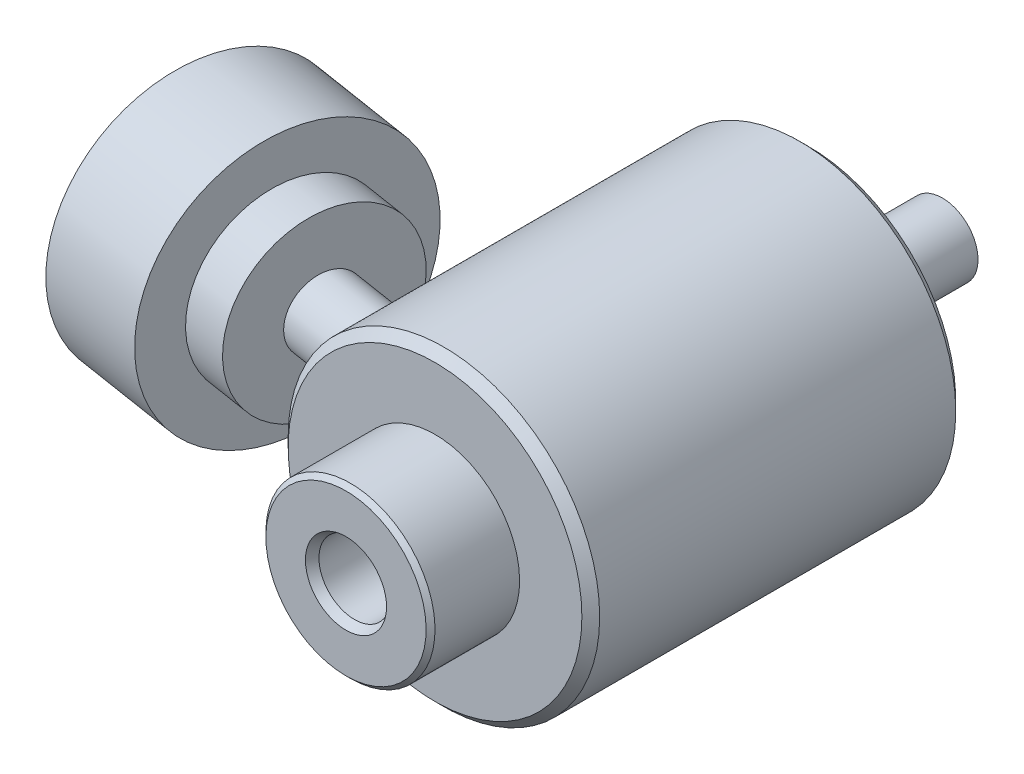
ISO-10303-21;
HEADER;
FILE_DESCRIPTION(('STEP AP214'),'2;1');
FILE_NAME('part.step','',(''),(''),'','','');
FILE_SCHEMA(('AUTOMOTIVE_DESIGN { 1 0 10303 214 1 1 1 1 }'));
ENDSEC;
DATA;
#1=APPLICATION_CONTEXT('core data for automotive mechanical design processes');
#2=APPLICATION_PROTOCOL_DEFINITION('international standard','automotive_design',2000,#1);
#3=PRODUCT_CONTEXT('',#1,'mechanical');
#4=PRODUCT('Part','Part','',(#3));
#5=PRODUCT_RELATED_PRODUCT_CATEGORY('part','',(#4));
#6=PRODUCT_DEFINITION_FORMATION('','',#4);
#7=PRODUCT_DEFINITION_CONTEXT('part definition',#1,'design');
#8=PRODUCT_DEFINITION('design','',#6,#7);
#9=PRODUCT_DEFINITION_SHAPE('','',#8);
#10=(LENGTH_UNIT() NAMED_UNIT(*) SI_UNIT(.MILLI.,.METRE.));
#11=(NAMED_UNIT(*) PLANE_ANGLE_UNIT() SI_UNIT($,.RADIAN.));
#12=(NAMED_UNIT(*) SI_UNIT($,.STERADIAN.) SOLID_ANGLE_UNIT());
#13=UNCERTAINTY_MEASURE_WITH_UNIT(LENGTH_MEASURE(1.E-05),#10,'distance_accuracy_value','');
#14=(GEOMETRIC_REPRESENTATION_CONTEXT(3) GLOBAL_UNCERTAINTY_ASSIGNED_CONTEXT((#13)) GLOBAL_UNIT_ASSIGNED_CONTEXT((#10,
#11,#12)) REPRESENTATION_CONTEXT('',''));
#15=CARTESIAN_POINT('',(0.,0.,0.));
#16=DIRECTION('',(0.,0.,1.));
#17=DIRECTION('',(1.,0.,0.));
#18=AXIS2_PLACEMENT_3D('',#15,#16,#17);
#19=CARTESIAN_POINT('',(-37.1481458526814,0.,25.3880394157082));
#20=DIRECTION('',(0.987688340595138,0.,0.156434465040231));
#21=DIRECTION('',(-0.156434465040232,0.,0.987688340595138));
#22=AXIS2_PLACEMENT_3D('',#19,#20,#21);
#23=CYLINDRICAL_SURFACE('',#22,4.);
#24=CARTESIAN_POINT('',(-17.5,0.,32.549860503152));
#25=CARTESIAN_POINT('',(-17.4999957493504,0.224614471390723,32.5498539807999));
#26=CARTESIAN_POINT('',(-17.4956327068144,0.449318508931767,32.5313396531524));
#27=CARTESIAN_POINT('',(-17.4786392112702,0.892435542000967,32.4577221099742));
#28=CARTESIAN_POINT('',(-17.466003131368,1.11084415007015,32.4025939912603));
#29=CARTESIAN_POINT('',(-17.4338463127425,1.53500330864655,32.2571782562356));
#30=CARTESIAN_POINT('',(-17.4143281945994,1.74075864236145,32.1669040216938));
#31=CARTESIAN_POINT('',(-17.3705421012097,2.13387663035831,31.9534994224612));
#32=CARTESIAN_POINT('',(-17.3462746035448,2.32124113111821,31.8303723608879));
#33=CARTESIAN_POINT('',(-17.2956371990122,2.67254969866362,31.554214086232));
#34=CARTESIAN_POINT('',(-17.2692645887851,2.83646287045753,31.4011440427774));
#35=CARTESIAN_POINT('',(-17.2174178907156,3.13586762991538,31.0692182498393));
#36=CARTESIAN_POINT('',(-17.1919437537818,3.27136077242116,30.890363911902));
#37=CARTESIAN_POINT('',(-17.1450047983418,3.50904954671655,30.5132847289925));
#38=CARTESIAN_POINT('',(-17.1235096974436,3.61150148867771,30.3152252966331));
#39=CARTESIAN_POINT('',(-17.0867315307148,3.78169775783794,29.9041969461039));
#40=CARTESIAN_POINT('',(-17.071447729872,3.84944619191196,29.6912297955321));
#41=CARTESIAN_POINT('',(-17.0489280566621,3.94798646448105,29.2592561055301));
#42=CARTESIAN_POINT('',(-17.0415966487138,3.9792173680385,29.0403543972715));
#43=CARTESIAN_POINT('',(-17.0353528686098,4.00586319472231,28.6002825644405));
#44=CARTESIAN_POINT('',(-17.0364409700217,4.0012761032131,28.3791123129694));
#45=CARTESIAN_POINT('',(-17.0468237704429,3.95680559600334,27.9380003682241));
#46=CARTESIAN_POINT('',(-17.0562129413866,3.91651584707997,27.7181022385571));
#47=CARTESIAN_POINT('',(-17.0821528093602,3.80177307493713,27.287851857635));
#48=CARTESIAN_POINT('',(-17.0987051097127,3.72731240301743,27.0775017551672));
#49=CARTESIAN_POINT('',(-17.1378795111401,3.54292035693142,26.6635686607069));
#50=CARTESIAN_POINT('',(-17.1607139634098,3.43171388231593,26.460573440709));
#51=CARTESIAN_POINT('',(-17.2095501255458,3.17774497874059,26.0757614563));
#52=CARTESIAN_POINT('',(-17.2355525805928,3.03497511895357,25.8939496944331));
#53=CARTESIAN_POINT('',(-17.2885137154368,2.71731655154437,25.5523458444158));
#54=CARTESIAN_POINT('',(-17.3154801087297,2.54171848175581,25.3932124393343));
#55=CARTESIAN_POINT('',(-17.3665728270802,2.16521302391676,25.1077562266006));
#56=CARTESIAN_POINT('',(-17.3906996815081,1.96431036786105,24.9814272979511));
#57=CARTESIAN_POINT('',(-17.4324970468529,1.54923721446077,24.7698430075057));
#58=CARTESIAN_POINT('',(-17.4503460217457,1.33567891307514,24.6834256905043));
#59=CARTESIAN_POINT('',(-17.4784212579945,0.896184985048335,24.5497264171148));
#60=CARTESIAN_POINT('',(-17.4886512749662,0.670255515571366,24.5024251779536));
#61=CARTESIAN_POINT('',(-17.4998301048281,0.227725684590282,24.4508532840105));
#62=CARTESIAN_POINT('',(-17.5013210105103,0.0114294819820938,24.4440688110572));
#63=CARTESIAN_POINT('',(-17.4963048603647,-0.419085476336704,24.4671089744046));
#64=CARTESIAN_POINT('',(-17.489799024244,-0.63330454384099,24.4969280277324));
#65=CARTESIAN_POINT('',(-17.4697946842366,-1.04801423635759,24.5906483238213));
#66=CARTESIAN_POINT('',(-17.4564779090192,-1.24871532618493,24.6536650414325));
#67=CARTESIAN_POINT('',(-17.4243532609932,-1.63704573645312,24.8108094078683));
#68=CARTESIAN_POINT('',(-17.4055445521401,-1.8246730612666,24.9049417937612));
#69=CARTESIAN_POINT('',(-17.3635294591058,-2.18924524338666,25.1252195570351));
#70=CARTESIAN_POINT('',(-17.3401852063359,-2.3655305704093,25.2524280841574));
#71=CARTESIAN_POINT('',(-17.2919524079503,-2.69560016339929,25.5330478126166));
#72=CARTESIAN_POINT('',(-17.2670633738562,-2.84937725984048,25.6864673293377));
#73=CARTESIAN_POINT('',(-17.2166804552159,-3.13990421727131,26.0255416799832));
#74=CARTESIAN_POINT('',(-17.1912429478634,-3.27503349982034,26.2125956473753));
#75=CARTESIAN_POINT('',(-17.144170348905,-3.51314694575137,26.6066225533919));
#76=CARTESIAN_POINT('',(-17.1225360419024,-3.61612447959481,26.8135995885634));
#77=CARTESIAN_POINT('',(-17.0850498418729,-3.78935161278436,27.2478052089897));
#78=CARTESIAN_POINT('',(-17.0693664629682,-3.85866112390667,27.4754252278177));
#79=CARTESIAN_POINT('',(-17.046655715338,-3.95779784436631,27.9395346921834));
#80=CARTESIAN_POINT('',(-17.0396266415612,-3.98763283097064,28.176022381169));
#81=CARTESIAN_POINT('',(-17.0353470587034,-4.00587500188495,28.6441743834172));
#82=CARTESIAN_POINT('',(-17.0378324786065,-3.9954009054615,28.875792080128));
#83=CARTESIAN_POINT('',(-17.0518556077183,-3.93512027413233,29.3335629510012));
#84=CARTESIAN_POINT('',(-17.0633912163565,-3.88532286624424,29.5597173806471));
#85=CARTESIAN_POINT('',(-17.0936083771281,-3.75008091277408,29.9911728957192));
#86=CARTESIAN_POINT('',(-17.1120042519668,-3.66605044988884,30.1969386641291));
#87=CARTESIAN_POINT('',(-17.1538823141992,-3.46479928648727,30.5909656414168));
#88=CARTESIAN_POINT('',(-17.1773642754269,-3.34758006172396,30.7792276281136));
#89=CARTESIAN_POINT('',(-17.2266034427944,-3.08413874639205,31.1318911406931));
#90=CARTESIAN_POINT('',(-17.2523445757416,-2.93811357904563,31.2964422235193));
#91=CARTESIAN_POINT('',(-17.3034160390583,-2.62061004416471,31.598945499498));
#92=CARTESIAN_POINT('',(-17.3287462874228,-2.44912666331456,31.7368924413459));
#93=CARTESIAN_POINT('',(-17.3765824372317,-2.08299901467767,31.9843622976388));
#94=CARTESIAN_POINT('',(-17.3990460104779,-1.88807553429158,32.0934801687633));
#95=CARTESIAN_POINT('',(-17.4382827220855,-1.48246254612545,32.2780292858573));
#96=CARTESIAN_POINT('',(-17.4550595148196,-1.27178326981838,32.3534821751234));
#97=CARTESIAN_POINT('',(-17.4784899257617,-0.884370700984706,32.4571671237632));
#98=CARTESIAN_POINT('',(-17.4865066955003,-0.709420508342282,32.491873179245));
#99=CARTESIAN_POINT('',(-17.4972634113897,-0.356332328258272,32.5382224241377));
#100=CARTESIAN_POINT('',(-17.5000033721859,-0.178194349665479,32.5498656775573));
#101=CARTESIAN_POINT('',(-17.5,0.,32.549860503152));
#102=B_SPLINE_CURVE_WITH_KNOTS('',3,(#24,#25,#26,#27,#28,#29,#30,#31,#32,#33,#34,#35,#36,#37,
#38,#39,#40,#41,#42,#43,#44,#45,#46,#47,#48,#49,#50,#51,#52,#53,#54,#55,#56,#57,#58,#59,#60,#61,
#62,#63,#64,#65,#66,#67,#68,#69,#70,#71,#72,#73,#74,#75,#76,#77,#78,#79,#80,#81,#82,#83,#84,#85,
#86,#87,#88,#89,#90,#91,#92,#93,#94,#95,#96,#97,#98,#99,#100,#101),.UNSPECIFIED.,.T.,.F.,(4,2,2,
2,2,2,2,2,2,2,2,2,2,2,2,2,2,2,2,2,2,2,2,2,2,2,2,2,2,2,2,2,2,2,2,2,2,2,4),(0.,0.673201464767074,
1.34686128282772,2.02026485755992,2.6936007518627,3.36781569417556,4.04199374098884,
4.71080864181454,5.37954437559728,6.0401541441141,6.70080106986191,7.36906481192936,
8.03747820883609,8.73207239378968,9.42683027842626,10.1388354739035,10.8507077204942,
11.5402958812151,12.2295438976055,12.8755434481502,13.5214444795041,14.150946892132,
14.7805451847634,15.433628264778,16.0869189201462,16.7802373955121,17.4736987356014,
18.1855455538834,18.8972521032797,19.5893506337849,20.2812885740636,20.9471508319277,
21.61298348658,22.2744129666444,22.9359728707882,23.6063851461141,24.2763657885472,
24.8104410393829,25.3445148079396),.UNSPECIFIED.);
#103=CARTESIAN_POINT('',(-17.5,0.,32.549860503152));
#104=VERTEX_POINT('',#103);
#105=EDGE_CURVE('P0_E216',#104,#104,#102,.T.);
#106=ORIENTED_EDGE('',*,*,#105,.T.);
#107=EDGE_LOOP('',(#106));
#108=FACE_BOUND('',#107,.T.);
#109=CARTESIAN_POINT('',(-27.5181845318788,0.,26.9132754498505));
#110=DIRECTION('',(-0.987688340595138,0.,-0.156434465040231));
#111=DIRECTION('',(0.,1.,0.));
#112=AXIS2_PLACEMENT_3D('',#109,#110,#111);
#113=CIRCLE('',#112,4.);
#114=CARTESIAN_POINT('',(-27.5181845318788,4.00000000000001,26.9132754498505));
#115=VERTEX_POINT('',#114);
#116=EDGE_CURVE('P0_E212',#115,#115,#113,.T.);
#117=ORIENTED_EDGE('',*,*,#116,.F.);
#118=EDGE_LOOP('',(#117));
#119=FACE_BOUND('',#118,.T.);
#120=ADVANCED_FACE('P0_F15',(#108,#119),#23,.T.);
#121=CARTESIAN_POINT('',(-35.5515849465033,0.,29.6907703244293));
#122=DIRECTION('',(-0.987688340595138,0.,-0.156434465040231));
#123=DIRECTION('',(0.156434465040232,0.,-0.987688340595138));
#124=AXIS2_PLACEMENT_3D('',#121,#122,#123);
#125=PLANE('',#124);
#126=DIRECTION('',(0.135476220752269,0.5,-0.855363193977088));
#127=VECTOR('',#126,1.);
#128=CARTESIAN_POINT('',(-35.2387160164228,1.15470053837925,27.7153936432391));
#129=LINE('',#128,#127);
#130=CARTESIAN_POINT('',(-35.2387160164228,1.15470053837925,27.7153936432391));
#131=VERTEX_POINT('',#130);
#132=CARTESIAN_POINT('',(-34.9258470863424,2.3094010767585,25.7400169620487));
#133=VERTEX_POINT('',#132);
#134=EDGE_CURVE('P0_E360',#131,#133,#129,.T.);
#135=ORIENTED_EDGE('',*,*,#134,.T.);
#136=DIRECTION('',(-0.135476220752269,0.5,0.855363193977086));
#137=VECTOR('',#136,1.);
#138=CARTESIAN_POINT('',(-34.6129781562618,1.15470053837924,23.7646402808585));
#139=LINE('',#138,#137);
#140=CARTESIAN_POINT('',(-34.6129781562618,1.15470053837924,23.7646402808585));
#141=VERTEX_POINT('',#140);
#142=EDGE_CURVE('P0_E363',#141,#133,#139,.T.);
#143=ORIENTED_EDGE('',*,*,#142,.F.);
#144=DIRECTION('',(0.,1.,0.));
#145=VECTOR('',#144,1.);
#146=CARTESIAN_POINT('',(-34.6129781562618,-1.15470053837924,23.7646402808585));
#147=LINE('',#146,#145);
#148=CARTESIAN_POINT('',(-34.6129781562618,-1.15470053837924,23.7646402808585));
#149=VERTEX_POINT('',#148);
#150=EDGE_CURVE('P0_E377',#149,#141,#147,.T.);
#151=ORIENTED_EDGE('',*,*,#150,.F.);
#152=DIRECTION('',(-0.135476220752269,-0.5,0.855363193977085));
#153=VECTOR('',#152,1.);
#154=CARTESIAN_POINT('',(-34.6129781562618,-1.15470053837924,23.7646402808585));
#155=LINE('',#154,#153);
#156=CARTESIAN_POINT('',(-34.9258470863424,-2.30940107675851,25.7400169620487));
#157=VERTEX_POINT('',#156);
#158=EDGE_CURVE('P0_E379',#149,#157,#155,.T.);
#159=ORIENTED_EDGE('',*,*,#158,.T.);
#160=DIRECTION('',(0.135476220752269,-0.5,-0.855363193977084));
#161=VECTOR('',#160,1.);
#162=CARTESIAN_POINT('',(-35.2387160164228,-1.15470053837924,27.7153936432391));
#163=LINE('',#162,#161);
#164=CARTESIAN_POINT('',(-35.2387160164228,-1.15470053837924,27.7153936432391));
#165=VERTEX_POINT('',#164);
#166=EDGE_CURVE('P0_E402',#165,#157,#163,.T.);
#167=ORIENTED_EDGE('',*,*,#166,.F.);
#168=DIRECTION('',(0.,1.,0.));
#169=VECTOR('',#168,1.);
#170=CARTESIAN_POINT('',(-35.2387160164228,-1.15470053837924,27.7153936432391));
#171=LINE('',#170,#169);
#172=EDGE_CURVE('P0_E366',#165,#131,#171,.T.);
#173=ORIENTED_EDGE('',*,*,#172,.T.);
#174=EDGE_LOOP('',(#135,#143,#151,#159,#167,#173));
#175=FACE_BOUND('',#174,.T.);
#176=ADVANCED_FACE('P0_F17',(#175),#125,.T.);
#177=CARTESIAN_POINT('',(-34.6129781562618,-1.15470053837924,23.7646402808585));
#178=DIRECTION('',(-0.156434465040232,0.,0.987688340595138));
#179=DIRECTION('',(-0.987688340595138,0.,-0.156434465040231));
#180=AXIS2_PLACEMENT_3D('',#177,#178,#179);
#181=PLANE('',#180);
#182=DIRECTION('',(-0.987688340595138,0.,-0.156434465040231));
#183=VECTOR('',#182,1.);
#184=CARTESIAN_POINT('',(-34.6129781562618,1.15470053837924,23.7646402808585));
#185=LINE('',#184,#183);
#186=CARTESIAN_POINT('',(-37.0821990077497,1.15470053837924,23.3735541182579));
#187=VERTEX_POINT('',#186);
#188=EDGE_CURVE('P0_E375',#141,#187,#185,.T.);
#189=ORIENTED_EDGE('',*,*,#188,.T.);
#190=DIRECTION('',(0.,1.,0.));
#191=VECTOR('',#190,1.);
#192=CARTESIAN_POINT('',(-37.0821990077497,-1.15470053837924,23.3735541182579));
#193=LINE('',#192,#191);
#194=CARTESIAN_POINT('',(-37.0821990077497,-1.15470053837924,23.3735541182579));
#195=VERTEX_POINT('',#194);
#196=EDGE_CURVE('P0_E391',#195,#187,#193,.T.);
#197=ORIENTED_EDGE('',*,*,#196,.F.);
#198=DIRECTION('',(-0.987688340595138,0.,-0.156434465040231));
#199=VECTOR('',#198,1.);
#200=CARTESIAN_POINT('',(-34.6129781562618,-1.15470053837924,23.7646402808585));
#201=LINE('',#200,#199);
#202=EDGE_CURVE('P0_E415',#149,#195,#201,.T.);
#203=ORIENTED_EDGE('',*,*,#202,.F.);
#204=ORIENTED_EDGE('',*,*,#150,.T.);
#205=EDGE_LOOP('',(#189,#197,#203,#204));
#206=FACE_BOUND('',#205,.T.);
#207=ADVANCED_FACE('P0_F346',(#206),#181,.T.);
#208=CARTESIAN_POINT('',(-34.6129781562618,-1.15470053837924,23.7646402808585));
#209=DIRECTION('',(0.0782172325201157,-0.866025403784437,-0.493844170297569));
#210=DIRECTION('',(0.135476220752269,0.5,-0.855363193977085));
#211=AXIS2_PLACEMENT_3D('',#208,#209,#210);
#212=PLANE('',#211);
#213=ORIENTED_EDGE('',*,*,#202,.T.);
#214=DIRECTION('',(-0.135476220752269,-0.5,0.855363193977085));
#215=VECTOR('',#214,1.);
#216=CARTESIAN_POINT('',(-37.0821990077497,-1.15470053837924,23.3735541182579));
#217=LINE('',#216,#215);
#218=CARTESIAN_POINT('',(-37.3950679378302,-2.30940107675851,25.3489307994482));
#219=VERTEX_POINT('',#218);
#220=EDGE_CURVE('P0_E387',#195,#219,#217,.T.);
#221=ORIENTED_EDGE('',*,*,#220,.T.);
#222=DIRECTION('',(-0.987688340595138,0.,-0.156434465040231));
#223=VECTOR('',#222,1.);
#224=CARTESIAN_POINT('',(-34.9258470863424,-2.30940107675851,25.7400169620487));
#225=LINE('',#224,#223);
#226=EDGE_CURVE('P0_E418',#157,#219,#225,.T.);
#227=ORIENTED_EDGE('',*,*,#226,.F.);
#228=ORIENTED_EDGE('',*,*,#158,.F.);
#229=EDGE_LOOP('',(#213,#221,#227,#228));
#230=FACE_BOUND('',#229,.T.);
#231=ADVANCED_FACE('P0_F352',(#230),#212,.F.);
#232=CARTESIAN_POINT('',(-35.2387160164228,-1.15470053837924,27.7153936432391));
#233=DIRECTION('',(0.0782172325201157,0.866025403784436,-0.493844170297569));
#234=DIRECTION('',(-0.135476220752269,0.5,0.855363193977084));
#235=AXIS2_PLACEMENT_3D('',#232,#233,#234);
#236=PLANE('',#235);
#237=ORIENTED_EDGE('',*,*,#226,.T.);
#238=DIRECTION('',(0.135476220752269,-0.5,-0.855363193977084));
#239=VECTOR('',#238,1.);
#240=CARTESIAN_POINT('',(-37.7079368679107,-1.15470053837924,27.3243074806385));
#241=LINE('',#240,#239);
#242=CARTESIAN_POINT('',(-37.7079368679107,-1.15470053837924,27.3243074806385));
#243=VERTEX_POINT('',#242);
#244=EDGE_CURVE('P0_E383',#243,#219,#241,.T.);
#245=ORIENTED_EDGE('',*,*,#244,.F.);
#246=DIRECTION('',(-0.987688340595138,0.,-0.156434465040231));
#247=VECTOR('',#246,1.);
#248=CARTESIAN_POINT('',(-35.2387160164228,-1.15470053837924,27.7153936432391));
#249=LINE('',#248,#247);
#250=EDGE_CURVE('P0_E95',#165,#243,#249,.T.);
#251=ORIENTED_EDGE('',*,*,#250,.F.);
#252=ORIENTED_EDGE('',*,*,#166,.T.);
#253=EDGE_LOOP('',(#237,#245,#251,#252));
#254=FACE_BOUND('',#253,.T.);
#255=ADVANCED_FACE('P0_F447',(#254),#236,.T.);
#256=CARTESIAN_POINT('',(-35.2387160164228,-1.15470053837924,27.7153936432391));
#257=DIRECTION('',(-0.156434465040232,0.,0.987688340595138));
#258=DIRECTION('',(-0.987688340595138,0.,-0.156434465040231));
#259=AXIS2_PLACEMENT_3D('',#256,#257,#258);
#260=PLANE('',#259);
#261=ORIENTED_EDGE('',*,*,#250,.T.);
#262=DIRECTION('',(0.,1.,0.));
#263=VECTOR('',#262,1.);
#264=CARTESIAN_POINT('',(-37.7079368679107,-1.15470053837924,27.3243074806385));
#265=LINE('',#264,#263);
#266=CARTESIAN_POINT('',(-37.7079368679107,1.15470053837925,27.3243074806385));
#267=VERTEX_POINT('',#266);
#268=EDGE_CURVE('P0_E187',#243,#267,#265,.T.);
#269=ORIENTED_EDGE('',*,*,#268,.T.);
#270=DIRECTION('',(-0.987688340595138,0.,-0.156434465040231));
#271=VECTOR('',#270,1.);
#272=CARTESIAN_POINT('',(-35.2387160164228,1.15470053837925,27.7153936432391));
#273=LINE('',#272,#271);
#274=EDGE_CURVE('P0_E100',#131,#267,#273,.T.);
#275=ORIENTED_EDGE('',*,*,#274,.F.);
#276=ORIENTED_EDGE('',*,*,#172,.F.);
#277=EDGE_LOOP('',(#261,#269,#275,#276));
#278=FACE_BOUND('',#277,.T.);
#279=ADVANCED_FACE('P0_F443',(#278),#260,.F.);
#280=CARTESIAN_POINT('',(-35.2387160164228,1.15470053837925,27.7153936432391));
#281=DIRECTION('',(-0.0782172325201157,0.86602540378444,0.493844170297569));
#282=DIRECTION('',(-0.135476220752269,-0.5,0.855363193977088));
#283=AXIS2_PLACEMENT_3D('',#280,#281,#282);
#284=PLANE('',#283);
#285=ORIENTED_EDGE('',*,*,#274,.T.);
#286=DIRECTION('',(0.135476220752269,0.5,-0.855363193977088));
#287=VECTOR('',#286,1.);
#288=CARTESIAN_POINT('',(-37.7079368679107,1.15470053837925,27.3243074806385));
#289=LINE('',#288,#287);
#290=CARTESIAN_POINT('',(-37.3950679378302,2.3094010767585,25.3489307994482));
#291=VERTEX_POINT('',#290);
#292=EDGE_CURVE('P0_E19',#267,#291,#289,.T.);
#293=ORIENTED_EDGE('',*,*,#292,.T.);
#294=DIRECTION('',(-0.987688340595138,0.,-0.156434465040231));
#295=VECTOR('',#294,1.);
#296=CARTESIAN_POINT('',(-34.9258470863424,2.3094010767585,25.7400169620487));
#297=LINE('',#296,#295);
#298=EDGE_CURVE('P0_E368',#133,#291,#297,.T.);
#299=ORIENTED_EDGE('',*,*,#298,.F.);
#300=ORIENTED_EDGE('',*,*,#134,.F.);
#301=EDGE_LOOP('',(#285,#293,#299,#300));
#302=FACE_BOUND('',#301,.T.);
#303=ADVANCED_FACE('P0_F446',(#302),#284,.F.);
#304=CARTESIAN_POINT('',(-34.6129781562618,1.15470053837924,23.7646402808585));
#305=DIRECTION('',(-0.0782172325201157,-0.866025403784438,0.493844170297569));
#306=DIRECTION('',(0.135476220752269,-0.5,-0.855363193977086));
#307=AXIS2_PLACEMENT_3D('',#304,#305,#306);
#308=PLANE('',#307);
#309=ORIENTED_EDGE('',*,*,#142,.T.);
#310=ORIENTED_EDGE('',*,*,#298,.T.);
#311=DIRECTION('',(-0.135476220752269,0.5,0.855363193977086));
#312=VECTOR('',#311,1.);
#313=CARTESIAN_POINT('',(-37.0821990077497,1.15470053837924,23.3735541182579));
#314=LINE('',#313,#312);
#315=EDGE_CURVE('P0_E396',#187,#291,#314,.T.);
#316=ORIENTED_EDGE('',*,*,#315,.F.);
#317=ORIENTED_EDGE('',*,*,#188,.F.);
#318=EDGE_LOOP('',(#309,#310,#316,#317));
#319=FACE_BOUND('',#318,.T.);
#320=ADVANCED_FACE('P0_F372',(#319),#308,.T.);
#321=CARTESIAN_POINT('',(-37.3950679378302,0.,25.3489307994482));
#322=DIRECTION('',(0.987688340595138,0.,0.156434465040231));
#323=DIRECTION('',(-0.156434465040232,0.,0.987688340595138));
#324=AXIS2_PLACEMENT_3D('',#321,#322,#323);
#325=PLANE('',#324);
#326=ORIENTED_EDGE('',*,*,#315,.T.);
#327=ORIENTED_EDGE('',*,*,#292,.F.);
#328=ORIENTED_EDGE('',*,*,#268,.F.);
#329=ORIENTED_EDGE('',*,*,#244,.T.);
#330=ORIENTED_EDGE('',*,*,#220,.F.);
#331=ORIENTED_EDGE('',*,*,#196,.T.);
#332=EDGE_LOOP('',(#326,#327,#328,#329,#330,#331));
#333=FACE_BOUND('',#332,.T.);
#334=CARTESIAN_POINT('',(-37.3950679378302,0.,25.3489307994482));
#335=DIRECTION('',(0.987688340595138,0.,0.156434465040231));
#336=DIRECTION('',(-0.156434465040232,0.,0.987688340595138));
#337=AXIS2_PLACEMENT_3D('',#334,#335,#336);
#338=CIRCLE('',#337,3.5);
#339=CARTESIAN_POINT('',(-37.942588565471,0.,28.8058399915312));
#340=VERTEX_POINT('',#339);
#341=EDGE_CURVE('P0_E424',#340,#340,#338,.T.);
#342=ORIENTED_EDGE('',*,*,#341,.F.);
#343=EDGE_LOOP('',(#342));
#344=FACE_BOUND('',#343,.T.);
#345=ADVANCED_FACE('P0_F434',(#333,#344),#325,.F.);
#346=CARTESIAN_POINT('',(-36.9012237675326,0.,25.4271480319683));
#347=DIRECTION('',(0.987688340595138,0.,0.156434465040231));
#348=DIRECTION('',(-0.156434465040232,0.,0.987688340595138));
#349=AXIS2_PLACEMENT_3D('',#346,#347,#348);
#350=CONICAL_SURFACE('',#349,4.,0.785398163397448);
#351=ORIENTED_EDGE('',*,*,#341,.T.);
#352=EDGE_LOOP('',(#351));
#353=FACE_BOUND('',#352,.T.);
#354=CARTESIAN_POINT('',(-36.9012237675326,0.,25.4271480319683));
#355=DIRECTION('',(0.987688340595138,0.,0.156434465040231));
#356=DIRECTION('',(-0.156434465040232,0.,0.987688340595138));
#357=AXIS2_PLACEMENT_3D('',#354,#355,#356);
#358=CIRCLE('',#357,4.);
#359=CARTESIAN_POINT('',(-37.5269616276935,0.,29.3779013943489));
#360=VERTEX_POINT('',#359);
#361=EDGE_CURVE('P0_E225',#360,#360,#358,.T.);
#362=ORIENTED_EDGE('',*,*,#361,.F.);
#363=EDGE_LOOP('',(#362));
#364=FACE_BOUND('',#363,.T.);
#365=ADVANCED_FACE('P0_F356',(#353,#364),#350,.T.);
#366=CARTESIAN_POINT('',(0.,-15.,28.1547005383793));
#367=DIRECTION('',(0.,-1.,0.));
#368=DIRECTION('',(1.,0.,0.));
#369=AXIS2_PLACEMENT_3D('',#366,#367,#368);
#370=PLANE('',#369);
#371=DIRECTION('',(-0.866025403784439,0.,0.5));
#372=VECTOR('',#371,1.);
#373=CARTESIAN_POINT('',(1.,-15.,27.5773502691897));
#374=LINE('',#373,#372);
#375=CARTESIAN_POINT('',(1.,-15.,27.5773502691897));
#376=VERTEX_POINT('',#375);
#377=CARTESIAN_POINT('',(0.,-15.,28.1547005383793));
#378=VERTEX_POINT('',#377);
#379=EDGE_CURVE('P0_E149',#376,#378,#374,.T.);
#380=ORIENTED_EDGE('',*,*,#379,.T.);
#381=DIRECTION('',(-0.866025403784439,0.,-0.5));
#382=VECTOR('',#381,1.);
#383=CARTESIAN_POINT('',(0.,-15.,28.1547005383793));
#384=LINE('',#383,#382);
#385=CARTESIAN_POINT('',(-1.,-15.,27.5773502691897));
#386=VERTEX_POINT('',#385);
#387=EDGE_CURVE('P0_E175',#378,#386,#384,.T.);
#388=ORIENTED_EDGE('',*,*,#387,.T.);
#389=DIRECTION('',(0.,0.,-1.));
#390=VECTOR('',#389,1.);
#391=CARTESIAN_POINT('',(-1.,-15.,27.5773502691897));
#392=LINE('',#391,#390);
#393=CARTESIAN_POINT('',(-1.,-15.,26.4226497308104));
#394=VERTEX_POINT('',#393);
#395=EDGE_CURVE('P0_E171',#386,#394,#392,.T.);
#396=ORIENTED_EDGE('',*,*,#395,.T.);
#397=DIRECTION('',(0.866025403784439,0.,-0.5));
#398=VECTOR('',#397,1.);
#399=CARTESIAN_POINT('',(-1.,-15.,26.4226497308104));
#400=LINE('',#399,#398);
#401=CARTESIAN_POINT('',(0.,-15.,25.8452994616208));
#402=VERTEX_POINT('',#401);
#403=EDGE_CURVE('P0_E168',#394,#402,#400,.T.);
#404=ORIENTED_EDGE('',*,*,#403,.T.);
#405=DIRECTION('',(0.866025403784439,0.,0.5));
#406=VECTOR('',#405,1.);
#407=CARTESIAN_POINT('',(0.,-15.,25.8452994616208));
#408=LINE('',#407,#406);
#409=CARTESIAN_POINT('',(1.,-15.,26.4226497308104));
#410=VERTEX_POINT('',#409);
#411=EDGE_CURVE('P0_E123',#402,#410,#408,.T.);
#412=ORIENTED_EDGE('',*,*,#411,.T.);
#413=DIRECTION('',(0.,0.,1.));
#414=VECTOR('',#413,1.);
#415=CARTESIAN_POINT('',(1.,-15.,26.4226497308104));
#416=LINE('',#415,#414);
#417=EDGE_CURVE('P0_E161',#410,#376,#416,.T.);
#418=ORIENTED_EDGE('',*,*,#417,.T.);
#419=EDGE_LOOP('',(#380,#388,#396,#404,#412,#418));
#420=FACE_BOUND('',#419,.T.);
#421=ADVANCED_FACE('P0_F318',(#420),#370,.T.);
#422=CARTESIAN_POINT('',(0.,-15.,28.1547005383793));
#423=DIRECTION('',(-0.5,0.,0.866025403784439));
#424=DIRECTION('',(-0.866025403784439,0.,-0.5));
#425=AXIS2_PLACEMENT_3D('',#422,#423,#424);
#426=PLANE('',#425);
#427=DIRECTION('',(-0.866025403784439,0.,-0.5));
#428=VECTOR('',#427,1.);
#429=CARTESIAN_POINT('',(0.,-16.5,28.1547005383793));
#430=LINE('',#429,#428);
#431=CARTESIAN_POINT('',(0.,-16.5,28.1547005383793));
#432=VERTEX_POINT('',#431);
#433=CARTESIAN_POINT('',(-1.,-16.5,27.5773502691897));
#434=VERTEX_POINT('',#433);
#435=EDGE_CURVE('P0_E155',#432,#434,#430,.T.);
#436=ORIENTED_EDGE('',*,*,#435,.T.);
#437=DIRECTION('',(0.,-1.,0.));
#438=VECTOR('',#437,1.);
#439=CARTESIAN_POINT('',(-1.,-15.,27.5773502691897));
#440=LINE('',#439,#438);
#441=EDGE_CURVE('P0_E35',#386,#434,#440,.T.);
#442=ORIENTED_EDGE('',*,*,#441,.F.);
#443=ORIENTED_EDGE('',*,*,#387,.F.);
#444=DIRECTION('',(0.,-1.,0.));
#445=VECTOR('',#444,1.);
#446=CARTESIAN_POINT('',(0.,-15.,28.1547005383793));
#447=LINE('',#446,#445);
#448=EDGE_CURVE('P0_E165',#378,#432,#447,.T.);
#449=ORIENTED_EDGE('',*,*,#448,.T.);
#450=EDGE_LOOP('',(#436,#442,#443,#449));
#451=FACE_BOUND('',#450,.T.);
#452=ADVANCED_FACE('P0_F439',(#451),#426,.F.);
#453=CARTESIAN_POINT('',(-1.,-15.,27.5773502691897));
#454=DIRECTION('',(-1.,0.,0.));
#455=DIRECTION('',(0.,0.,-1.));
#456=AXIS2_PLACEMENT_3D('',#453,#454,#455);
#457=PLANE('',#456);
#458=DIRECTION('',(0.,0.,-1.));
#459=VECTOR('',#458,1.);
#460=CARTESIAN_POINT('',(-1.,-16.5,27.5773502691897));
#461=LINE('',#460,#459);
#462=CARTESIAN_POINT('',(-1.,-16.5,26.4226497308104));
#463=VERTEX_POINT('',#462);
#464=EDGE_CURVE('P0_E137',#434,#463,#461,.T.);
#465=ORIENTED_EDGE('',*,*,#464,.T.);
#466=DIRECTION('',(0.,-1.,0.));
#467=VECTOR('',#466,1.);
#468=CARTESIAN_POINT('',(-1.,-15.,26.4226497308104));
#469=LINE('',#468,#467);
#470=EDGE_CURVE('P0_E128',#394,#463,#469,.T.);
#471=ORIENTED_EDGE('',*,*,#470,.F.);
#472=ORIENTED_EDGE('',*,*,#395,.F.);
#473=ORIENTED_EDGE('',*,*,#441,.T.);
#474=EDGE_LOOP('',(#465,#471,#472,#473));
#475=FACE_BOUND('',#474,.T.);
#476=ADVANCED_FACE('P0_F498',(#475),#457,.F.);
#477=CARTESIAN_POINT('',(-1.,-15.,26.4226497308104));
#478=DIRECTION('',(-0.5,0.,-0.866025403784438));
#479=DIRECTION('',(0.866025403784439,0.,-0.5));
#480=AXIS2_PLACEMENT_3D('',#477,#478,#479);
#481=PLANE('',#480);
#482=DIRECTION('',(0.866025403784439,0.,-0.5));
#483=VECTOR('',#482,1.);
#484=CARTESIAN_POINT('',(-1.,-16.5,26.4226497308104));
#485=LINE('',#484,#483);
#486=CARTESIAN_POINT('',(0.,-16.5,25.8452994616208));
#487=VERTEX_POINT('',#486);
#488=EDGE_CURVE('P0_E132',#463,#487,#485,.T.);
#489=ORIENTED_EDGE('',*,*,#488,.T.);
#490=DIRECTION('',(0.,-1.,0.));
#491=VECTOR('',#490,1.);
#492=CARTESIAN_POINT('',(0.,-15.,25.8452994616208));
#493=LINE('',#492,#491);
#494=EDGE_CURVE('P0_E116',#402,#487,#493,.T.);
#495=ORIENTED_EDGE('',*,*,#494,.F.);
#496=ORIENTED_EDGE('',*,*,#403,.F.);
#497=ORIENTED_EDGE('',*,*,#470,.T.);
#498=EDGE_LOOP('',(#489,#495,#496,#497));
#499=FACE_BOUND('',#498,.T.);
#500=ADVANCED_FACE('P0_F133',(#499),#481,.F.);
#501=CARTESIAN_POINT('',(0.,-15.,25.8452994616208));
#502=DIRECTION('',(0.5,0.,-0.866025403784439));
#503=DIRECTION('',(0.866025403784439,0.,0.5));
#504=AXIS2_PLACEMENT_3D('',#501,#502,#503);
#505=PLANE('',#504);
#506=DIRECTION('',(0.866025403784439,0.,0.5));
#507=VECTOR('',#506,1.);
#508=CARTESIAN_POINT('',(0.,-16.5,25.8452994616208));
#509=LINE('',#508,#507);
#510=CARTESIAN_POINT('',(1.,-16.5,26.4226497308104));
#511=VERTEX_POINT('',#510);
#512=EDGE_CURVE('P0_E120',#487,#511,#509,.T.);
#513=ORIENTED_EDGE('',*,*,#512,.T.);
#514=DIRECTION('',(0.,-1.,0.));
#515=VECTOR('',#514,1.);
#516=CARTESIAN_POINT('',(1.,-15.,26.4226497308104));
#517=LINE('',#516,#515);
#518=EDGE_CURVE('P0_E129',#410,#511,#517,.T.);
#519=ORIENTED_EDGE('',*,*,#518,.F.);
#520=ORIENTED_EDGE('',*,*,#411,.F.);
#521=ORIENTED_EDGE('',*,*,#494,.T.);
#522=EDGE_LOOP('',(#513,#519,#520,#521));
#523=FACE_BOUND('',#522,.T.);
#524=ADVANCED_FACE('P0_F118',(#523),#505,.F.);
#525=CARTESIAN_POINT('',(1.,-15.,26.4226497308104));
#526=DIRECTION('',(1.,0.,0.));
#527=DIRECTION('',(0.,1.,0.));
#528=AXIS2_PLACEMENT_3D('',#525,#526,#527);
#529=PLANE('',#528);
#530=DIRECTION('',(0.,0.,1.));
#531=VECTOR('',#530,1.);
#532=CARTESIAN_POINT('',(1.,-16.5,26.4226497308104));
#533=LINE('',#532,#531);
#534=CARTESIAN_POINT('',(1.,-16.5,27.5773502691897));
#535=VERTEX_POINT('',#534);
#536=EDGE_CURVE('P0_E142',#511,#535,#533,.T.);
#537=ORIENTED_EDGE('',*,*,#536,.T.);
#538=DIRECTION('',(0.,-1.,0.));
#539=VECTOR('',#538,1.);
#540=CARTESIAN_POINT('',(1.,-15.,27.5773502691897));
#541=LINE('',#540,#539);
#542=EDGE_CURVE('P0_E808',#376,#535,#541,.T.);
#543=ORIENTED_EDGE('',*,*,#542,.F.);
#544=ORIENTED_EDGE('',*,*,#417,.F.);
#545=ORIENTED_EDGE('',*,*,#518,.T.);
#546=EDGE_LOOP('',(#537,#543,#544,#545));
#547=FACE_BOUND('',#546,.T.);
#548=ADVANCED_FACE('P0_F527',(#547),#529,.F.);
#549=CARTESIAN_POINT('',(1.,-15.,27.5773502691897));
#550=DIRECTION('',(0.5,0.,0.866025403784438));
#551=DIRECTION('',(-0.866025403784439,0.,0.5));
#552=AXIS2_PLACEMENT_3D('',#549,#550,#551);
#553=PLANE('',#552);
#554=DIRECTION('',(-0.866025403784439,0.,0.5));
#555=VECTOR('',#554,1.);
#556=CARTESIAN_POINT('',(1.,-16.5,27.5773502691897));
#557=LINE('',#556,#555);
#558=EDGE_CURVE('P0_E106',#535,#432,#557,.T.);
#559=ORIENTED_EDGE('',*,*,#558,.T.);
#560=ORIENTED_EDGE('',*,*,#448,.F.);
#561=ORIENTED_EDGE('',*,*,#379,.F.);
#562=ORIENTED_EDGE('',*,*,#542,.T.);
#563=EDGE_LOOP('',(#559,#560,#561,#562));
#564=FACE_BOUND('',#563,.T.);
#565=ADVANCED_FACE('P0_F291',(#564),#553,.F.);
#566=CARTESIAN_POINT('',(0.,0.,0.));
#567=DIRECTION('',(0.,0.,1.));
#568=DIRECTION('',(1.,0.,0.));
#569=AXIS2_PLACEMENT_3D('',#566,#567,#568);
#570=CYLINDRICAL_SURFACE('',#569,4.5);
#571=CARTESIAN_POINT('',(0.,0.,0.));
#572=DIRECTION('',(0.,0.,1.));
#573=DIRECTION('',(1.,0.,0.));
#574=AXIS2_PLACEMENT_3D('',#571,#572,#573);
#575=CIRCLE('',#574,4.5);
#576=CARTESIAN_POINT('',(4.5,0.,0.));
#577=VERTEX_POINT('',#576);
#578=EDGE_CURVE('P0_E281',#577,#577,#575,.T.);
#579=ORIENTED_EDGE('',*,*,#578,.F.);
#580=EDGE_LOOP('',(#579));
#581=FACE_BOUND('',#580,.T.);
#582=CARTESIAN_POINT('',(0.,0.,5.));
#583=DIRECTION('',(0.,0.,1.));
#584=DIRECTION('',(1.,0.,0.));
#585=AXIS2_PLACEMENT_3D('',#582,#583,#584);
#586=CIRCLE('',#585,4.5);
#587=CARTESIAN_POINT('',(4.5,0.,5.));
#588=VERTEX_POINT('',#587);
#589=EDGE_CURVE('P0_E254',#588,#588,#586,.T.);
#590=ORIENTED_EDGE('',*,*,#589,.T.);
#591=EDGE_LOOP('',(#590));
#592=FACE_BOUND('',#591,.T.);
#593=ADVANCED_FACE('P0_F289',(#581,#592),#570,.F.);
#594=CARTESIAN_POINT('',(0.,-16.5,27.));
#595=DIRECTION('',(0.,-1.,0.));
#596=DIRECTION('',(1.,0.,0.));
#597=AXIS2_PLACEMENT_3D('',#594,#595,#596);
#598=PLANE('',#597);
#599=ORIENTED_EDGE('',*,*,#558,.F.);
#600=ORIENTED_EDGE('',*,*,#536,.F.);
#601=ORIENTED_EDGE('',*,*,#512,.F.);
#602=ORIENTED_EDGE('',*,*,#488,.F.);
#603=ORIENTED_EDGE('',*,*,#464,.F.);
#604=ORIENTED_EDGE('',*,*,#435,.F.);
#605=EDGE_LOOP('',(#599,#600,#601,#602,#603,#604));
#606=FACE_BOUND('',#605,.T.);
#607=CARTESIAN_POINT('',(0.,-16.5,27.));
#608=DIRECTION('',(0.,-1.,0.));
#609=DIRECTION('',(1.,0.,0.));
#610=AXIS2_PLACEMENT_3D('',#607,#608,#609);
#611=CIRCLE('',#610,2.);
#612=CARTESIAN_POINT('',(2.,-16.5,27.));
#613=VERTEX_POINT('',#612);
#614=EDGE_CURVE('P0_E211',#613,#613,#611,.T.);
#615=ORIENTED_EDGE('',*,*,#614,.T.);
#616=EDGE_LOOP('',(#615));
#617=FACE_BOUND('',#616,.T.);
#618=ADVANCED_FACE('P0_F139',(#606,#617),#598,.T.);
#619=CARTESIAN_POINT('',(17.5,0.,0.));
#620=DIRECTION('',(0.,0.,-1.));
#621=DIRECTION('',(-1.,0.,0.));
#622=AXIS2_PLACEMENT_3D('',#619,#620,#621);
#623=PLANE('',#622);
#624=CARTESIAN_POINT('',(0.,0.,0.));
#625=DIRECTION('',(0.,0.,-1.));
#626=DIRECTION('',(-1.,0.,0.));
#627=AXIS2_PLACEMENT_3D('',#624,#625,#626);
#628=CIRCLE('',#627,16.5);
#629=CARTESIAN_POINT('',(-16.5,0.,0.));
#630=VERTEX_POINT('',#629);
#631=EDGE_CURVE('P0_E160',#630,#630,#628,.T.);
#632=ORIENTED_EDGE('',*,*,#631,.T.);
#633=EDGE_LOOP('',(#632));
#634=FACE_BOUND('',#633,.T.);
#635=ORIENTED_EDGE('',*,*,#578,.T.);
#636=EDGE_LOOP('',(#635));
#637=FACE_BOUND('',#636,.T.);
#638=ADVANCED_FACE('P0_F241',(#634,#637),#623,.T.);
#639=CARTESIAN_POINT('',(0.,-7.5,27.));
#640=DIRECTION('',(0.,-1.,0.));
#641=DIRECTION('',(0.,0.,-1.));
#642=AXIS2_PLACEMENT_3D('',#639,#640,#641);
#643=CYLINDRICAL_SURFACE('',#642,2.);
#644=CARTESIAN_POINT('',(0.,-17.5,25.));
#645=CARTESIAN_POINT('',(-0.111949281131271,-17.4999985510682,25.0000048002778));
#646=CARTESIAN_POINT('',(-0.223970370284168,-17.4989143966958,25.0094311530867));
#647=CARTESIAN_POINT('',(-0.444900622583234,-17.4946937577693,25.0468888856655));
#648=CARTESIAN_POINT('',(-0.553806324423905,-17.4915550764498,25.0749401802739));
#649=CARTESIAN_POINT('',(-0.765274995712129,-17.4835792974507,25.1488150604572));
#650=CARTESIAN_POINT('',(-0.867841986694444,-17.4787432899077,25.1946272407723));
#651=CARTESIAN_POINT('',(-1.06381060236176,-17.4679120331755,25.3026997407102));
#652=CARTESIAN_POINT('',(-1.15721390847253,-17.4619169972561,25.3649570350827));
#653=CARTESIAN_POINT('',(-1.33265783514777,-17.4494069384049,25.5044617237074));
#654=CARTESIAN_POINT('',(-1.41464987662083,-17.4428898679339,25.5817700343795));
#655=CARTESIAN_POINT('',(-1.5645257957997,-17.4300869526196,25.7490517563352));
#656=CARTESIAN_POINT('',(-1.63240898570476,-17.4238011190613,25.8390257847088));
#657=CARTESIAN_POINT('',(-1.75231750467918,-17.4121519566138,26.029395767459));
#658=CARTESIAN_POINT('',(-1.80429797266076,-17.4067912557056,26.129820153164));
#659=CARTESIAN_POINT('',(-1.89063905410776,-17.3976257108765,26.3380439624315));
#660=CARTESIAN_POINT('',(-1.9250002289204,-17.3938208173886,26.4458431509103));
#661=CARTESIAN_POINT('',(-1.97498120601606,-17.3882168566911,26.6652558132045));
#662=CARTESIAN_POINT('',(-1.99068245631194,-17.3864090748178,26.7768505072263));
#663=CARTESIAN_POINT('',(-2.00314979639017,-17.3849772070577,27.0011045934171));
#664=CARTESIAN_POINT('',(-1.99991652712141,-17.3853530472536,27.1137639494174));
#665=CARTESIAN_POINT('',(-1.9746735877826,-17.3882379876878,27.3363845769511));
#666=CARTESIAN_POINT('',(-1.95275327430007,-17.3907369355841,27.4463561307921));
#667=CARTESIAN_POINT('',(-1.89089772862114,-17.3975706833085,27.6610493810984));
#668=CARTESIAN_POINT('',(-1.85096218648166,-17.4019055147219,27.7657709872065));
#669=CARTESIAN_POINT('',(-1.7541125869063,-17.4119342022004,27.9672714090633));
#670=CARTESIAN_POINT('',(-1.69715932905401,-17.4176311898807,28.0640312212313));
#671=CARTESIAN_POINT('',(-1.56791908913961,-17.4297397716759,28.2466532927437));
#672=CARTESIAN_POINT('',(-1.49563152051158,-17.4361513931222,28.3325151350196));
#673=CARTESIAN_POINT('',(-1.33727766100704,-17.4490120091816,28.4914228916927));
#674=CARTESIAN_POINT('',(-1.25113428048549,-17.455461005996,28.5643920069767));
#675=CARTESIAN_POINT('',(-1.06778054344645,-17.4676349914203,28.6948462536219));
#676=CARTESIAN_POINT('',(-0.970570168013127,-17.4733599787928,28.752331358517));
#677=CARTESIAN_POINT('',(-0.767785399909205,-17.4834436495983,28.8501844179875));
#678=CARTESIAN_POINT('',(-0.662208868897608,-17.487801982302,28.8905479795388));
#679=CARTESIAN_POINT('',(-0.445716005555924,-17.4946579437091,28.9529533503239));
#680=CARTESIAN_POINT('',(-0.334799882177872,-17.4971556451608,28.9749958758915));
#681=CARTESIAN_POINT('',(-0.111440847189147,-17.4999995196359,29.0000348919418));
#682=CARTESIAN_POINT('',(0.00099004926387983,-17.5003576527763,29.0031372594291));
#683=CARTESIAN_POINT('',(0.224770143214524,-17.4989142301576,28.9904867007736));
#684=CARTESIAN_POINT('',(0.33611935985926,-17.4971127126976,28.9747341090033));
#685=CARTESIAN_POINT('',(0.554265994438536,-17.4915599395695,28.9249086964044));
#686=CARTESIAN_POINT('',(0.661074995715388,-17.4878140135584,28.890885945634));
#687=CARTESIAN_POINT('',(0.867470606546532,-17.4787921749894,28.8055377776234));
#688=CARTESIAN_POINT('',(0.967057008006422,-17.4735162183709,28.7542118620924));
#689=CARTESIAN_POINT('',(1.1566560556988,-17.4619935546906,28.6354552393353));
#690=CARTESIAN_POINT('',(1.24662524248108,-17.4557427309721,28.5679555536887));
#691=CARTESIAN_POINT('',(1.41399482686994,-17.4429836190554,28.4188656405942));
#692=CARTESIAN_POINT('',(1.49139480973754,-17.4364753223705,28.3372749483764));
#693=CARTESIAN_POINT('',(1.63180089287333,-17.4238982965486,28.1618546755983));
#694=CARTESIAN_POINT('',(1.69473712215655,-17.4178317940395,28.0679689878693));
#695=CARTESIAN_POINT('',(1.80394755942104,-17.4068606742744,27.8708980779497));
#696=CARTESIAN_POINT('',(1.85022205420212,-17.4019560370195,27.7677130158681));
#697=CARTESIAN_POINT('',(1.92468057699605,-17.3938786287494,27.5552042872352));
#698=CARTESIAN_POINT('',(1.9529049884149,-17.3907019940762,27.4458949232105));
#699=CARTESIAN_POINT('',(1.99059267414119,-17.3864287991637,27.2240499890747));
#700=CARTESIAN_POINT('',(2.00005666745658,-17.385332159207,27.1115145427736));
#701=CARTESIAN_POINT('',(1.99994314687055,-17.385345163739,26.8871066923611));
#702=CARTESIAN_POINT('',(1.99047539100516,-17.3864420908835,26.7752342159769));
#703=CARTESIAN_POINT('',(1.95299850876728,-17.3906913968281,26.5546810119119));
#704=CARTESIAN_POINT('',(1.92498937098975,-17.3938437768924,26.4460002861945));
#705=CARTESIAN_POINT('',(1.85125733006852,-17.4018450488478,26.2349239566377));
#706=CARTESIAN_POINT('',(1.80553879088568,-17.4066935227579,26.1325268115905));
#707=CARTESIAN_POINT('',(1.69769666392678,-17.4175414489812,25.9368408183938));
#708=CARTESIAN_POINT('',(1.63557300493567,-17.4235409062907,25.8435520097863));
#709=CARTESIAN_POINT('',(1.496274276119,-17.4360565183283,25.6681688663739));
#710=CARTESIAN_POINT('',(1.41901733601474,-17.4425753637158,25.5861397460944));
#711=CARTESIAN_POINT('',(1.25181311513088,-17.4553710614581,25.4361657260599));
#712=CARTESIAN_POINT('',(1.16186282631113,-17.4616478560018,25.3682241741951));
#713=CARTESIAN_POINT('',(0.971500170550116,-17.4732739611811,25.248173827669));
#714=CARTESIAN_POINT('',(0.871055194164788,-17.4786202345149,25.1961164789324));
#715=CARTESIAN_POINT('',(0.662847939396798,-17.4877513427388,25.1096797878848));
#716=CARTESIAN_POINT('',(0.555093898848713,-17.4915379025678,25.0752809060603));
#717=CARTESIAN_POINT('',(0.372298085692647,-17.4961924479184,25.0335288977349));
#718=CARTESIAN_POINT('',(0.298416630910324,-17.4976134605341,25.0209732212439));
#719=CARTESIAN_POINT('',(0.149700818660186,-17.499517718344,25.0042071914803));
#720=CARTESIAN_POINT('',(0.0748664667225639,-17.5000009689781,24.9999967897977));
#721=CARTESIAN_POINT('',(0.,-17.5,25.));
#722=B_SPLINE_CURVE_WITH_KNOTS('',3,(#644,#645,#646,#647,#648,#649,#650,#651,#652,#653,#654,
#655,#656,#657,#658,#659,#660,#661,#662,#663,#664,#665,#666,#667,#668,#669,#670,#671,#672,#673,
#674,#675,#676,#677,#678,#679,#680,#681,#682,#683,#684,#685,#686,#687,#688,#689,#690,#691,#692,
#693,#694,#695,#696,#697,#698,#699,#700,#701,#702,#703,#704,#705,#706,#707,#708,#709,#710,#711,
#712,#713,#714,#715,#716,#717,#718,#719,#720,#721),.UNSPECIFIED.,.T.,.F.,(4,2,2,2,2,2,2,2,2,2,2,
2,2,2,2,2,2,2,2,2,2,2,2,2,2,2,2,2,2,2,2,2,2,2,2,2,2,2,4),(0.,0.33557441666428,0.67150822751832,
1.00722667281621,1.34288340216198,1.67992799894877,2.01698902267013,2.35499229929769,
2.69298480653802,3.0294965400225,3.3659968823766,3.7008971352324,4.03580315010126,
4.37148664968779,4.70718299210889,5.04481612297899,5.38244983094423,5.72017011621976,
6.05787719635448,6.39369472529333,6.72950629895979,7.06440223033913,7.3993078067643,
7.73566795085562,8.07203919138,8.41000271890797,8.74796042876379,9.08515935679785,
9.42234536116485,9.7575821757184,10.0928191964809,10.4279736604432,10.763129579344,
11.1001514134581,11.4372532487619,11.7754355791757,12.1132428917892,12.3376607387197,
12.5620772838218),.UNSPECIFIED.);
#723=CARTESIAN_POINT('',(0.,-17.5,25.));
#724=VERTEX_POINT('',#723);
#725=EDGE_CURVE('P0_E10',#724,#724,#722,.T.);
#726=ORIENTED_EDGE('',*,*,#725,.F.);
#727=EDGE_LOOP('',(#726));
#728=FACE_BOUND('',#727,.T.);
#729=ORIENTED_EDGE('',*,*,#614,.F.);
#730=EDGE_LOOP('',(#729));
#731=FACE_BOUND('',#730,.T.);
#732=ADVANCED_FACE('P0_F239',(#728,#731),#643,.F.);
#733=CARTESIAN_POINT('',(-24.5233400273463,0.,8.88761222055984));
#734=DIRECTION('',(-0.987688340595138,0.,-0.156434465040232));
#735=DIRECTION('',(-0.156434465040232,0.,0.987688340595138));
#736=AXIS2_PLACEMENT_3D('',#733,#734,#735);
#737=CYLINDRICAL_SURFACE('',#736,1.25);
#738=CARTESIAN_POINT('',(-17.5,0.,11.265581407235));
#739=CARTESIAN_POINT('',(-17.4999994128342,0.0699765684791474,11.2655783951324));
#740=CARTESIAN_POINT('',(-17.499575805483,0.140001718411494,11.2596792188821));
#741=CARTESIAN_POINT('',(-17.4979265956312,0.278119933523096,11.2362271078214));
#742=CARTESIAN_POINT('',(-17.4967000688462,0.346210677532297,11.2186607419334));
#743=CARTESIAN_POINT('',(-17.493583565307,0.478441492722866,11.1723706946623));
#744=CARTESIAN_POINT('',(-17.491693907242,0.542583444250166,11.1436523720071));
#745=CARTESIAN_POINT('',(-17.4874637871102,0.665111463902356,11.0758775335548));
#746=CARTESIAN_POINT('',(-17.4851234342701,0.723498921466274,11.0368235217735));
#747=CARTESIAN_POINT('',(-17.4802526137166,0.832932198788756,10.9494526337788));
#748=CARTESIAN_POINT('',(-17.4777220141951,0.883972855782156,10.901129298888));
#749=CARTESIAN_POINT('',(-17.4727554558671,0.977243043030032,10.7966139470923));
#750=CARTESIAN_POINT('',(-17.4703195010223,1.01947220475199,10.7404216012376));
#751=CARTESIAN_POINT('',(-17.4658062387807,1.09408364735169,10.6215850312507));
#752=CARTESIAN_POINT('',(-17.4637300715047,1.1264348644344,10.5589212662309));
#753=CARTESIAN_POINT('',(-17.4601750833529,1.18026163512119,10.4290713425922));
#754=CARTESIAN_POINT('',(-17.458696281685,1.20173683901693,10.3618850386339));
#755=CARTESIAN_POINT('',(-17.4564876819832,1.23340768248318,10.22434920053));
#756=CARTESIAN_POINT('',(-17.4557637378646,1.24351521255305,10.1539792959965));
#757=CARTESIAN_POINT('',(-17.455160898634,1.25194887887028,10.0125341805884));
#758=CARTESIAN_POINT('',(-17.4552820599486,1.25027422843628,9.94145892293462));
#759=CARTESIAN_POINT('',(-17.456357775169,1.23516416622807,9.7997397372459));
#760=CARTESIAN_POINT('',(-17.4573220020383,1.22159224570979,9.72911043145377));
#761=CARTESIAN_POINT('',(-17.4599852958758,1.18291416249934,9.59109593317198));
#762=CARTESIAN_POINT('',(-17.4616844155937,1.15780717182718,9.52371097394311));
#763=CARTESIAN_POINT('',(-17.4656428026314,1.09648060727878,9.39349963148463));
#764=CARTESIAN_POINT('',(-17.467906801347,1.06016652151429,9.33071786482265));
#765=CARTESIAN_POINT('',(-17.4727286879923,0.977477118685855,9.21217909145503));
#766=CARTESIAN_POINT('',(-17.4752865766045,0.931101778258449,9.15642210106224));
#767=CARTESIAN_POINT('',(-17.4803911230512,0.829749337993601,9.05382068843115));
#768=CARTESIAN_POINT('',(-17.4829377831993,0.774808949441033,9.00694003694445));
#769=CARTESIAN_POINT('',(-17.4877346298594,0.65769619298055,8.9232805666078));
#770=CARTESIAN_POINT('',(-17.4899848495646,0.595524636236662,8.88650061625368));
#771=CARTESIAN_POINT('',(-17.4938841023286,0.466979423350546,8.82486405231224));
#772=CARTESIAN_POINT('',(-17.4955438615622,0.400709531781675,8.79979180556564));
#773=CARTESIAN_POINT('',(-17.498127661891,0.264837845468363,8.76139083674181));
#774=CARTESIAN_POINT('',(-17.4990518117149,0.195236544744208,8.74806037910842));
#775=CARTESIAN_POINT('',(-17.5000442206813,0.056317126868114,8.73376570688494));
#776=CARTESIAN_POINT('',(-17.5001308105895,-0.0129737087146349,8.73253663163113));
#777=CARTESIAN_POINT('',(-17.4994862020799,-0.150760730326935,8.74179567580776));
#778=CARTESIAN_POINT('',(-17.4987550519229,-0.219256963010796,8.75228310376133));
#779=CARTESIAN_POINT('',(-17.4965662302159,-0.353009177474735,8.78450143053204));
#780=CARTESIAN_POINT('',(-17.495113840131,-0.418284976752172,8.80615063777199));
#781=CARTESIAN_POINT('',(-17.4916459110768,-0.544337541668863,8.85994605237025));
#782=CARTESIAN_POINT('',(-17.4896303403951,-0.605114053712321,8.8920928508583));
#783=CARTESIAN_POINT('',(-17.4852257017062,-0.721326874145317,8.96638177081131));
#784=CARTESIAN_POINT('',(-17.482832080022,-0.77668264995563,9.00864950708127));
#785=CARTESIAN_POINT('',(-17.4779512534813,-0.879707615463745,9.1016897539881));
#786=CARTESIAN_POINT('',(-17.4754640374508,-0.927375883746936,9.15246328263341));
#787=CARTESIAN_POINT('',(-17.4706071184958,-1.01481668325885,9.26232481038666));
#788=CARTESIAN_POINT('',(-17.4682413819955,-1.05438466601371,9.32157583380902));
#789=CARTESIAN_POINT('',(-17.4639515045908,-1.12320577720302,9.44580882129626));
#790=CARTESIAN_POINT('',(-17.4620274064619,-1.15245790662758,9.51079133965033));
#791=CARTESIAN_POINT('',(-17.4588083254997,-1.20024948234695,9.64576831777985));
#792=CARTESIAN_POINT('',(-17.4575238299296,-1.21861123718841,9.71582603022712));
#793=CARTESIAN_POINT('',(-17.4557794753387,-1.24334983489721,9.85803888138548));
#794=CARTESIAN_POINT('',(-17.4553196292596,-1.24972648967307,9.93019405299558));
#795=CARTESIAN_POINT('',(-17.4552817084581,-1.25025635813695,10.074589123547));
#796=CARTESIAN_POINT('',(-17.4557040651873,-1.24440359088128,10.1468290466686));
#797=CARTESIAN_POINT('',(-17.4573880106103,-1.22055111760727,10.2892664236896));
#798=CARTESIAN_POINT('',(-17.4586495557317,-1.20255204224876,10.359463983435));
#799=CARTESIAN_POINT('',(-17.4618527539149,-1.15509903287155,10.4950465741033));
#800=CARTESIAN_POINT('',(-17.4637872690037,-1.12576497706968,10.5604737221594));
#801=CARTESIAN_POINT('',(-17.468118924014,-1.05641964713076,10.6853819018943));
#802=CARTESIAN_POINT('',(-17.4705160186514,-1.0164094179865,10.7448635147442));
#803=CARTESIAN_POINT('',(-17.4754688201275,-0.927335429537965,10.8555034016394));
#804=CARTESIAN_POINT('',(-17.478022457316,-0.878377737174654,10.906747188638));
#805=CARTESIAN_POINT('',(-17.4830223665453,-0.772484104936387,11.0002313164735));
#806=CARTESIAN_POINT('',(-17.485468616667,-0.715546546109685,11.0424698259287));
#807=CARTESIAN_POINT('',(-17.489960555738,-0.595694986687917,11.1164855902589));
#808=CARTESIAN_POINT('',(-17.4920085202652,-0.532818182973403,11.1483230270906));
#809=CARTESIAN_POINT('',(-17.4954880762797,-0.402639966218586,11.2009432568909));
#810=CARTESIAN_POINT('',(-17.4969203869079,-0.335343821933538,11.2217389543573));
#811=CARTESIAN_POINT('',(-17.498633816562,-0.223033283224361,11.2463180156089));
#812=CARTESIAN_POINT('',(-17.4991438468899,-0.178743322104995,11.2535325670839));
#813=CARTESIAN_POINT('',(-17.4998271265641,-0.0896422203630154,11.2631652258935));
#814=CARTESIAN_POINT('',(-17.5000003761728,-0.0448310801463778,11.265583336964));
#815=CARTESIAN_POINT('',(-17.5,0.,11.265581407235));
#816=B_SPLINE_CURVE_WITH_KNOTS('',3,(#738,#739,#740,#741,#742,#743,#744,#745,#746,#747,#748,
#749,#750,#751,#752,#753,#754,#755,#756,#757,#758,#759,#760,#761,#762,#763,#764,#765,#766,#767,
#768,#769,#770,#771,#772,#773,#774,#775,#776,#777,#778,#779,#780,#781,#782,#783,#784,#785,#786,
#787,#788,#789,#790,#791,#792,#793,#794,#795,#796,#797,#798,#799,#800,#801,#802,#803,#804,#805,
#806,#807,#808,#809,#810,#811,#812,#813,#814,#815),.UNSPECIFIED.,.T.,.F.,(4,2,2,2,2,2,2,2,2,2,2,
2,2,2,2,2,2,2,2,2,2,2,2,2,2,2,2,2,2,2,2,2,2,2,2,2,2,2,4),(0.,0.209766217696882,
0.419774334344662,0.629681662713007,0.83953818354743,1.04954146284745,1.25955352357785,
1.47021937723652,1.68089200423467,1.89318651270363,2.1054951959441,2.32027226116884,
2.53506474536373,2.75172054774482,2.96837685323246,3.1841288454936,3.39985665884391,
3.61143708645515,3.82298623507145,4.02989467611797,4.23679090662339,4.44219394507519,
4.64760855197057,4.85571841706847,5.06385320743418,5.27672821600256,5.48962383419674,
5.70590384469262,5.9221872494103,6.13857645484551,6.35495442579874,6.56910400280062,
6.78323262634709,6.99497057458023,7.20675154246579,7.41728447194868,7.62757080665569,
7.76195941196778,7.89634791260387),.UNSPECIFIED.);
#817=CARTESIAN_POINT('',(-17.5,0.,11.265581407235));
#818=VERTEX_POINT('',#817);
#819=EDGE_CURVE('P0_E246',#818,#818,#816,.T.);
#820=ORIENTED_EDGE('',*,*,#819,.T.);
#821=EDGE_LOOP('',(#820));
#822=FACE_BOUND('',#821,.T.);
#823=CARTESIAN_POINT('',(-9.5,0.,12.5326569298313));
#824=CARTESIAN_POINT('',(-9.4999989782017,0.0701723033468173,12.5326541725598));
#825=CARTESIAN_POINT('',(-9.49921437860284,0.140387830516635,12.5267794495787));
#826=CARTESIAN_POINT('',(-9.4961591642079,0.278878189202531,12.5034182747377));
#827=CARTESIAN_POINT('',(-9.49388701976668,0.347150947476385,12.4859198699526));
#828=CARTESIAN_POINT('',(-9.48811086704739,0.479744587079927,12.4397800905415));
#829=CARTESIAN_POINT('',(-9.48460730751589,0.544066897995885,12.4111427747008));
#830=CARTESIAN_POINT('',(-9.47676062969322,0.666935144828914,12.3435051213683));
#831=CARTESIAN_POINT('',(-9.47241769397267,0.725482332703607,12.3045070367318));
#832=CARTESIAN_POINT('',(-9.46338416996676,0.835096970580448,12.2172557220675));
#833=CARTESIAN_POINT('',(-9.45869391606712,0.886171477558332,12.1690113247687));
#834=CARTESIAN_POINT('',(-9.44949036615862,0.979456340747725,12.064587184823));
#835=CARTESIAN_POINT('',(-9.44497707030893,1.02166668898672,12.0084074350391));
#836=CARTESIAN_POINT('',(-9.43664622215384,1.09595032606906,11.8898520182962));
#837=CARTESIAN_POINT('',(-9.4328269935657,1.12804817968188,11.827491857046));
#838=CARTESIAN_POINT('',(-9.42629520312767,1.18139114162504,11.6982401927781));
#839=CARTESIAN_POINT('',(-9.42358263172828,1.2026363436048,11.6313487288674));
#840=CARTESIAN_POINT('',(-9.41955329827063,1.23380128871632,11.4947827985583));
#841=CARTESIAN_POINT('',(-9.41823968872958,1.24369545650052,11.4251024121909));
#842=CARTESIAN_POINT('',(-9.41715066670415,1.25191472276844,11.2850534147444));
#843=CARTESIAN_POINT('',(-9.41737536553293,1.25023898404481,11.214684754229));
#844=CARTESIAN_POINT('',(-9.41933628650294,1.23537846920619,11.0742094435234));
#845=CARTESIAN_POINT('',(-9.4210934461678,1.2220342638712,11.0041199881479));
#846=CARTESIAN_POINT('',(-9.42593872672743,1.184078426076,10.8671076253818));
#847=CARTESIAN_POINT('',(-9.42902702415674,1.15946529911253,10.8001851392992));
#848=CARTESIAN_POINT('',(-9.4362570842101,1.09908638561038,10.670052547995));
#849=CARTESIAN_POINT('',(-9.44041803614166,1.063114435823,10.606939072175));
#850=CARTESIAN_POINT('',(-9.44928883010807,0.981139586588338,10.4876362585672));
#851=CARTESIAN_POINT('',(-9.45399871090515,0.935135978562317,10.4314474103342));
#852=CARTESIAN_POINT('',(-9.46344944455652,0.834088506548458,10.3274530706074));
#853=CARTESIAN_POINT('',(-9.46819034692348,0.77901065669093,10.2796805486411));
#854=CARTESIAN_POINT('',(-9.47713083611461,0.661407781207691,10.1943310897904));
#855=CARTESIAN_POINT('',(-9.48133050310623,0.598883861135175,10.1567526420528));
#856=CARTESIAN_POINT('',(-9.48859219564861,0.469776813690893,10.0939086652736));
#857=CARTESIAN_POINT('',(-9.49167979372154,0.403332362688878,10.0683615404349));
#858=CARTESIAN_POINT('',(-9.49649253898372,0.266974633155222,10.0291791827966));
#859=CARTESIAN_POINT('',(-9.49821802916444,0.1970622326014,10.0155409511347));
#860=CARTESIAN_POINT('',(-9.50006438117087,0.0584207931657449,10.0009697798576));
#861=CARTESIAN_POINT('',(-9.50024001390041,-0.0102621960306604,9.99960313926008));
#862=CARTESIAN_POINT('',(-9.49911035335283,-0.146854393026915,10.0084915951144));
#863=CARTESIAN_POINT('',(-9.49780519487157,-0.214763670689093,10.0187456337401));
#864=CARTESIAN_POINT('',(-9.4938879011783,-0.347013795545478,10.0502914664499));
#865=CARTESIAN_POINT('',(-9.49129239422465,-0.411388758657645,10.0714429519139));
#866=CARTESIAN_POINT('',(-9.48508516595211,-0.535762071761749,10.1239751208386));
#867=CARTESIAN_POINT('',(-9.48147334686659,-0.595759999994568,10.1553567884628));
#868=CARTESIAN_POINT('',(-9.47352779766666,-0.711119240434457,10.2281425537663));
#869=CARTESIAN_POINT('',(-9.4691800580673,-0.76635111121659,10.2697500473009));
#870=CARTESIAN_POINT('',(-9.46028236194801,-0.869329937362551,10.3613585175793));
#871=CARTESIAN_POINT('',(-9.45573236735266,-0.917075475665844,10.4113610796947));
#872=CARTESIAN_POINT('',(-9.44674658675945,-1.00549887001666,10.5202817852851));
#873=CARTESIAN_POINT('',(-9.44232058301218,-1.04586580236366,10.5794533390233));
#874=CARTESIAN_POINT('',(-9.43424840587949,-1.11634214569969,10.7036713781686));
#875=CARTESIAN_POINT('',(-9.43060233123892,-1.14645025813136,10.7687186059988));
#876=CARTESIAN_POINT('',(-9.42444076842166,-1.19605910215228,10.9042062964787));
#877=CARTESIAN_POINT('',(-9.4219480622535,-1.21534756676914,10.9747257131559));
#878=CARTESIAN_POINT('',(-9.41849874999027,-1.24179791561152,11.1180429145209));
#879=CARTESIAN_POINT('',(-9.41754207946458,-1.24896030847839,11.1908406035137));
#880=CARTESIAN_POINT('',(-9.41729514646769,-1.25082101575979,11.3359861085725));
#881=CARTESIAN_POINT('',(-9.41799082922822,-1.245624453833,11.408332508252));
#882=CARTESIAN_POINT('',(-9.42095480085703,-1.22300422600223,11.5510552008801));
#883=CARTESIAN_POINT('',(-9.42322291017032,-1.20558195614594,11.6214317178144));
#884=CARTESIAN_POINT('',(-9.42901695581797,-1.15938156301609,11.7567497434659));
#885=CARTESIAN_POINT('',(-9.43251730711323,-1.13083324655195,11.8217708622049));
#886=CARTESIAN_POINT('',(-9.44038589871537,-1.06314136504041,11.9459806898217));
#887=CARTESIAN_POINT('',(-9.44475405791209,-1.0239987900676,12.0051699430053));
#888=CARTESIAN_POINT('',(-9.45380669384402,-0.936715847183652,12.1153801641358));
#889=CARTESIAN_POINT('',(-9.45848709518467,-0.888680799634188,12.1664849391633));
#890=CARTESIAN_POINT('',(-9.46768215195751,-0.784674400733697,12.2598981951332));
#891=CARTESIAN_POINT('',(-9.47219677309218,-0.728701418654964,12.3022048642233));
#892=CARTESIAN_POINT('',(-9.48055413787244,-0.610415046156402,12.3768505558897));
#893=CARTESIAN_POINT('',(-9.48439679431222,-0.548100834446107,12.4091882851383));
#894=CARTESIAN_POINT('',(-9.49097752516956,-0.418940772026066,12.4629917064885));
#895=CARTESIAN_POINT('',(-9.49371671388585,-0.352099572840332,12.4844683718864));
#896=CARTESIAN_POINT('',(-9.49714647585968,-0.237454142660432,12.5110065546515));
#897=CARTESIAN_POINT('',(-9.49821134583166,-0.190342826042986,12.5191147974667));
#898=CARTESIAN_POINT('',(-9.49963845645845,-0.0954943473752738,12.5299409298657));
#899=CARTESIAN_POINT('',(-9.50000069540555,-0.0477571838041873,12.5326588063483));
#900=CARTESIAN_POINT('',(-9.5,0.,12.5326569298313));
#901=B_SPLINE_CURVE_WITH_KNOTS('',3,(#823,#824,#825,#826,#827,#828,#829,#830,#831,#832,#833,
#834,#835,#836,#837,#838,#839,#840,#841,#842,#843,#844,#845,#846,#847,#848,#849,#850,#851,#852,
#853,#854,#855,#856,#857,#858,#859,#860,#861,#862,#863,#864,#865,#866,#867,#868,#869,#870,#871,
#872,#873,#874,#875,#876,#877,#878,#879,#880,#881,#882,#883,#884,#885,#886,#887,#888,#889,#890,
#891,#892,#893,#894,#895,#896,#897,#898,#899,#900),.UNSPECIFIED.,.T.,.F.,(4,2,2,2,2,2,2,2,2,2,2,
2,2,2,2,2,2,2,2,2,2,2,2,2,2,2,2,2,2,2,2,2,2,2,2,2,2,2,4),(0.,0.210343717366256,
0.420904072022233,0.631387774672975,0.841825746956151,1.0520636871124,1.26230181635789,
1.47202523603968,1.68174684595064,1.89194006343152,2.10214849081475,2.31527473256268,
2.52842924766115,2.7456994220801,2.96298494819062,3.18110359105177,3.39918988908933,
3.61188125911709,3.82451905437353,4.02961091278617,4.23468410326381,4.43718054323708,
4.63969646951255,4.84662304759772,5.05358874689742,5.26789875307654,5.48223587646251,
5.7006428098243,5.91904058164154,6.13558734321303,6.3521093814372,6.5643778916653,
6.77662657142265,6.98650591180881,7.19642843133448,7.40637817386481,7.61611537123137,
7.759268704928,7.90242238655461),.UNSPECIFIED.);
#902=CARTESIAN_POINT('',(-9.5,0.,12.5326569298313));
#903=VERTEX_POINT('',#902);
#904=EDGE_CURVE('P0_E26',#903,#903,#901,.T.);
#905=ORIENTED_EDGE('',*,*,#904,.F.);
#906=EDGE_LOOP('',(#905));
#907=FACE_BOUND('',#906,.T.);
#908=ADVANCED_FACE('P0_F261',(#822,#907),#737,.F.);
#909=CARTESIAN_POINT('',(0.,0.,1.));
#910=DIRECTION('',(0.,0.,1.));
#911=DIRECTION('',(1.,0.,0.));
#912=AXIS2_PLACEMENT_3D('',#909,#910,#911);
#913=CONICAL_SURFACE('',#912,17.5,0.785398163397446);
#914=ORIENTED_EDGE('',*,*,#631,.F.);
#915=EDGE_LOOP('',(#914));
#916=FACE_BOUND('',#915,.T.);
#917=CARTESIAN_POINT('',(0.,0.,1.));
#918=DIRECTION('',(0.,0.,-1.));
#919=DIRECTION('',(-1.,0.,0.));
#920=AXIS2_PLACEMENT_3D('',#917,#918,#919);
#921=CIRCLE('',#920,17.5);
#922=CARTESIAN_POINT('',(-17.5,0.,1.));
#923=VERTEX_POINT('',#922);
#924=EDGE_CURVE('P0_E772',#923,#923,#921,.F.);
#925=ORIENTED_EDGE('',*,*,#924,.F.);
#926=EDGE_LOOP('',(#925));
#927=FACE_BOUND('',#926,.T.);
#928=ADVANCED_FACE('P0_F265',(#916,#927),#913,.T.);
#929=CARTESIAN_POINT('',(0.,0.,42.));
#930=DIRECTION('',(0.,0.,-1.));
#931=DIRECTION('',(-1.,0.,0.));
#932=AXIS2_PLACEMENT_3D('',#929,#930,#931);
#933=CONICAL_SURFACE('',#932,16.5,0.785398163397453);
#934=CARTESIAN_POINT('',(0.,0.,41.));
#935=DIRECTION('',(0.,0.,1.));
#936=DIRECTION('',(1.,0.,0.));
#937=AXIS2_PLACEMENT_3D('',#934,#935,#936);
#938=CIRCLE('',#937,17.5);
#939=CARTESIAN_POINT('',(17.5,0.,41.));
#940=VERTEX_POINT('',#939);
#941=EDGE_CURVE('P0_E769',#940,#940,#938,.F.);
#942=ORIENTED_EDGE('',*,*,#941,.F.);
#943=EDGE_LOOP('',(#942));
#944=FACE_BOUND('',#943,.T.);
#945=CARTESIAN_POINT('',(0.,0.,42.));
#946=DIRECTION('',(0.,0.,1.));
#947=DIRECTION('',(1.,0.,0.));
#948=AXIS2_PLACEMENT_3D('',#945,#946,#947);
#949=CIRCLE('',#948,16.5);
#950=CARTESIAN_POINT('',(16.5,0.,42.));
#951=VERTEX_POINT('',#950);
#952=EDGE_CURVE('P0_E279',#951,#951,#949,.T.);
#953=ORIENTED_EDGE('',*,*,#952,.F.);
#954=EDGE_LOOP('',(#953));
#955=FACE_BOUND('',#954,.T.);
#956=ADVANCED_FACE('P0_F236',(#944,#955),#933,.T.);
#957=CARTESIAN_POINT('',(0.,0.,0.));
#958=DIRECTION('',(0.,0.,1.));
#959=DIRECTION('',(1.,0.,0.));
#960=AXIS2_PLACEMENT_3D('',#957,#958,#959);
#961=CYLINDRICAL_SURFACE('',#960,17.5);
#962=ORIENTED_EDGE('',*,*,#941,.T.);
#963=EDGE_LOOP('',(#962));
#964=FACE_BOUND('',#963,.T.);
#965=ORIENTED_EDGE('',*,*,#924,.T.);
#966=EDGE_LOOP('',(#965));
#967=FACE_BOUND('',#966,.T.);
#968=ORIENTED_EDGE('',*,*,#819,.F.);
#969=EDGE_LOOP('',(#968));
#970=FACE_BOUND('',#969,.T.);
#971=ORIENTED_EDGE('',*,*,#105,.F.);
#972=EDGE_LOOP('',(#971));
#973=FACE_BOUND('',#972,.T.);
#974=ORIENTED_EDGE('',*,*,#725,.T.);
#975=EDGE_LOOP('',(#974));
#976=FACE_BOUND('',#975,.T.);
#977=ADVANCED_FACE('P0_F230',(#964,#967,#970,#973,#976),#961,.T.);
#978=CARTESIAN_POINT('',(9.5,0.,5.));
#979=DIRECTION('',(0.,0.,-1.));
#980=DIRECTION('',(-1.,0.,0.));
#981=AXIS2_PLACEMENT_3D('',#978,#979,#980);
#982=PLANE('',#981);
#983=ORIENTED_EDGE('',*,*,#589,.F.);
#984=EDGE_LOOP('',(#983));
#985=FACE_BOUND('',#984,.T.);
#986=CARTESIAN_POINT('',(0.,0.,5.));
#987=DIRECTION('',(0.,0.,1.));
#988=DIRECTION('',(1.,0.,0.));
#989=AXIS2_PLACEMENT_3D('',#986,#987,#988);
#990=CIRCLE('',#989,9.5);
#991=CARTESIAN_POINT('',(9.5,0.,5.));
#992=VERTEX_POINT('',#991);
#993=EDGE_CURVE('P0_E793',#992,#992,#990,.T.);
#994=ORIENTED_EDGE('',*,*,#993,.T.);
#995=EDGE_LOOP('',(#994));
#996=FACE_BOUND('',#995,.T.);
#997=ADVANCED_FACE('P0_F235',(#985,#996),#982,.F.);
#998=CARTESIAN_POINT('',(0.,0.,42.));
#999=DIRECTION('',(0.,0.,1.));
#1000=DIRECTION('',(1.,0.,0.));
#1001=AXIS2_PLACEMENT_3D('',#998,#999,#1000);
#1002=PLANE('',#1001);
#1003=ORIENTED_EDGE('',*,*,#952,.T.);
#1004=EDGE_LOOP('',(#1003));
#1005=FACE_BOUND('',#1004,.T.);
#1006=CARTESIAN_POINT('',(0.,0.,42.));
#1007=DIRECTION('',(0.,0.,1.));
#1008=DIRECTION('',(1.,0.,0.));
#1009=AXIS2_PLACEMENT_3D('',#1006,#1007,#1008);
#1010=CIRCLE('',#1009,9.5);
#1011=CARTESIAN_POINT('',(9.5,0.,42.));
#1012=VERTEX_POINT('',#1011);
#1013=EDGE_CURVE('P0_E776',#1012,#1012,#1010,.T.);
#1014=ORIENTED_EDGE('',*,*,#1013,.F.);
#1015=EDGE_LOOP('',(#1014));
#1016=FACE_BOUND('',#1015,.T.);
#1017=ADVANCED_FACE('P0_F287',(#1005,#1016),#1002,.T.);
#1018=CARTESIAN_POINT('',(0.,0.,0.));
#1019=DIRECTION('',(0.,0.,1.));
#1020=DIRECTION('',(1.,0.,0.));
#1021=AXIS2_PLACEMENT_3D('',#1018,#1019,#1020);
#1022=CYLINDRICAL_SURFACE('',#1021,9.5);
#1023=ORIENTED_EDGE('',*,*,#1013,.T.);
#1024=EDGE_LOOP('',(#1023));
#1025=FACE_BOUND('',#1024,.T.);
#1026=ORIENTED_EDGE('',*,*,#904,.T.);
#1027=EDGE_LOOP('',(#1026));
#1028=FACE_BOUND('',#1027,.T.);
#1029=ORIENTED_EDGE('',*,*,#993,.F.);
#1030=EDGE_LOOP('',(#1029));
#1031=FACE_BOUND('',#1030,.T.);
#1032=ADVANCED_FACE('P0_F238',(#1025,#1028,#1031),#1022,.F.);
#1033=CARTESIAN_POINT('',(-44.3088863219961,-12.,24.2538895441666));
#1034=DIRECTION('',(-0.987688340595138,0.,-0.156434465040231));
#1035=DIRECTION('',(0.,1.,0.));
#1036=AXIS2_PLACEMENT_3D('',#1033,#1034,#1035);
#1037=PLANE('',#1036);
#1038=CARTESIAN_POINT('',(-44.3088863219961,0.,24.2538895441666));
#1039=DIRECTION('',(-0.987688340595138,0.,-0.156434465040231));
#1040=DIRECTION('',(0.,1.,0.));
#1041=AXIS2_PLACEMENT_3D('',#1038,#1039,#1040);
#1042=CIRCLE('',#1041,15.);
#1043=CARTESIAN_POINT('',(-44.3088863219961,15.,24.2538895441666));
#1044=VERTEX_POINT('',#1043);
#1045=EDGE_CURVE('P0_E195',#1044,#1044,#1042,.T.);
#1046=ORIENTED_EDGE('',*,*,#1045,.T.);
#1047=EDGE_LOOP('',(#1046));
#1048=FACE_BOUND('',#1047,.T.);
#1049=CARTESIAN_POINT('',(-44.3088863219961,0.,24.2538895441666));
#1050=DIRECTION('',(-0.987688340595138,0.,-0.156434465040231));
#1051=DIRECTION('',(0.,1.,0.));
#1052=AXIS2_PLACEMENT_3D('',#1049,#1050,#1051);
#1053=CIRCLE('',#1052,12.);
#1054=CARTESIAN_POINT('',(-44.3088863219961,12.,24.2538895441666));
#1055=VERTEX_POINT('',#1054);
#1056=EDGE_CURVE('P0_E199',#1055,#1055,#1053,.T.);
#1057=ORIENTED_EDGE('',*,*,#1056,.F.);
#1058=EDGE_LOOP('',(#1057));
#1059=FACE_BOUND('',#1058,.T.);
#1060=ADVANCED_FACE('P0_F286',(#1048,#1059),#1037,.T.);
#1061=CARTESIAN_POINT('',(-47.2719513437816,0.,23.7845861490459));
#1062=DIRECTION('',(-0.987688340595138,0.,-0.156434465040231));
#1063=DIRECTION('',(0.,1.,0.));
#1064=AXIS2_PLACEMENT_3D('',#1061,#1062,#1063);
#1065=CYLINDRICAL_SURFACE('',#1064,12.);
#1066=ORIENTED_EDGE('',*,*,#1056,.T.);
#1067=EDGE_LOOP('',(#1066));
#1068=FACE_BOUND('',#1067,.T.);
#1069=CARTESIAN_POINT('',(-37.3950679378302,0.,25.3489307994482));
#1070=DIRECTION('',(-0.987688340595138,0.,-0.156434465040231));
#1071=DIRECTION('',(0.,1.,0.));
#1072=AXIS2_PLACEMENT_3D('',#1069,#1070,#1071);
#1073=CIRCLE('',#1072,12.);
#1074=CARTESIAN_POINT('',(-37.3950679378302,12.,25.3489307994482));
#1075=VERTEX_POINT('',#1074);
#1076=EDGE_CURVE('P0_E203',#1075,#1075,#1073,.T.);
#1077=ORIENTED_EDGE('',*,*,#1076,.F.);
#1078=EDGE_LOOP('',(#1077));
#1079=FACE_BOUND('',#1078,.T.);
#1080=ADVANCED_FACE('P0_F331',(#1068,#1079),#1065,.F.);
#1081=CARTESIAN_POINT('',(-37.3950679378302,-4.,25.3489307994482));
#1082=DIRECTION('',(-0.987688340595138,0.,-0.156434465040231));
#1083=DIRECTION('',(0.,1.,0.));
#1084=AXIS2_PLACEMENT_3D('',#1081,#1082,#1083);
#1085=PLANE('',#1084);
#1086=ORIENTED_EDGE('',*,*,#1076,.T.);
#1087=EDGE_LOOP('',(#1086));
#1088=FACE_BOUND('',#1087,.T.);
#1089=CARTESIAN_POINT('',(-37.3950679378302,0.,25.3489307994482));
#1090=DIRECTION('',(-0.987688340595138,0.,-0.156434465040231));
#1091=DIRECTION('',(0.,1.,0.));
#1092=AXIS2_PLACEMENT_3D('',#1089,#1090,#1091);
#1093=CIRCLE('',#1092,4.);
#1094=CARTESIAN_POINT('',(-37.3950679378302,4.00000000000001,25.3489307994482));
#1095=VERTEX_POINT('',#1094);
#1096=EDGE_CURVE('P0_E207',#1095,#1095,#1093,.T.);
#1097=ORIENTED_EDGE('',*,*,#1096,.F.);
#1098=EDGE_LOOP('',(#1097));
#1099=FACE_BOUND('',#1098,.T.);
#1100=ADVANCED_FACE('P0_F335',(#1088,#1099),#1085,.T.);
#1101=CARTESIAN_POINT('',(-47.2719513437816,0.,23.7845861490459));
#1102=DIRECTION('',(-0.987688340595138,0.,-0.156434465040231));
#1103=DIRECTION('',(0.,1.,0.));
#1104=AXIS2_PLACEMENT_3D('',#1101,#1102,#1103);
#1105=CYLINDRICAL_SURFACE('',#1104,4.);
#1106=ORIENTED_EDGE('',*,*,#361,.T.);
#1107=EDGE_LOOP('',(#1106));
#1108=FACE_BOUND('',#1107,.T.);
#1109=ORIENTED_EDGE('',*,*,#1096,.T.);
#1110=EDGE_LOOP('',(#1109));
#1111=FACE_BOUND('',#1110,.T.);
#1112=ADVANCED_FACE('P0_F327',(#1108,#1111),#1105,.F.);
#1113=CARTESIAN_POINT('',(-47.2719513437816,0.,23.7845861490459));
#1114=DIRECTION('',(-0.987688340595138,0.,-0.156434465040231));
#1115=DIRECTION('',(0.,1.,0.));
#1116=AXIS2_PLACEMENT_3D('',#1113,#1114,#1115);
#1117=CYLINDRICAL_SURFACE('',#1116,15.);
#1118=CARTESIAN_POINT('',(-32.4566262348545,0.,26.1311031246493));
#1119=DIRECTION('',(-0.987688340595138,0.,-0.156434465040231));
#1120=DIRECTION('',(0.,1.,0.));
#1121=AXIS2_PLACEMENT_3D('',#1118,#1119,#1120);
#1122=CIRCLE('',#1121,15.);
#1123=CARTESIAN_POINT('',(-32.4566262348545,15.,26.1311031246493));
#1124=VERTEX_POINT('',#1123);
#1125=EDGE_CURVE('P0_E191',#1124,#1124,#1122,.T.);
#1126=ORIENTED_EDGE('',*,*,#1125,.T.);
#1127=EDGE_LOOP('',(#1126));
#1128=FACE_BOUND('',#1127,.T.);
#1129=ORIENTED_EDGE('',*,*,#1045,.F.);
#1130=EDGE_LOOP('',(#1129));
#1131=FACE_BOUND('',#1130,.T.);
#1132=ADVANCED_FACE('P0_F323',(#1128,#1131),#1117,.T.);
#1133=CARTESIAN_POINT('',(-32.4566262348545,-10.,26.1311031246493));
#1134=DIRECTION('',(-0.987688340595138,0.,-0.156434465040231));
#1135=DIRECTION('',(0.,1.,0.));
#1136=AXIS2_PLACEMENT_3D('',#1133,#1134,#1135);
#1137=PLANE('',#1136);
#1138=ORIENTED_EDGE('',*,*,#1125,.F.);
#1139=EDGE_LOOP('',(#1138));
#1140=FACE_BOUND('',#1139,.T.);
#1141=CARTESIAN_POINT('',(-32.4566262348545,0.,26.1311031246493));
#1142=DIRECTION('',(-0.987688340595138,0.,-0.156434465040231));
#1143=DIRECTION('',(0.,1.,0.));
#1144=AXIS2_PLACEMENT_3D('',#1141,#1142,#1143);
#1145=CIRCLE('',#1144,10.);
#1146=CARTESIAN_POINT('',(-32.4566262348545,10.,26.1311031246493));
#1147=VERTEX_POINT('',#1146);
#1148=EDGE_CURVE('P0_E186',#1147,#1147,#1145,.T.);
#1149=ORIENTED_EDGE('',*,*,#1148,.T.);
#1150=EDGE_LOOP('',(#1149));
#1151=FACE_BOUND('',#1150,.T.);
#1152=ADVANCED_FACE('P0_F312',(#1140,#1151),#1137,.F.);
#1153=CARTESIAN_POINT('',(-47.2719513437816,0.,23.7845861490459));
#1154=DIRECTION('',(-0.987688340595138,0.,-0.156434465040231));
#1155=DIRECTION('',(0.,1.,0.));
#1156=AXIS2_PLACEMENT_3D('',#1153,#1154,#1155);
#1157=CYLINDRICAL_SURFACE('',#1156,10.);
#1158=CARTESIAN_POINT('',(-27.5181845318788,0.,26.9132754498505));
#1159=DIRECTION('',(-0.987688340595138,0.,-0.156434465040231));
#1160=DIRECTION('',(0.,1.,0.));
#1161=AXIS2_PLACEMENT_3D('',#1158,#1159,#1160);
#1162=CIRCLE('',#1161,10.);
#1163=CARTESIAN_POINT('',(-27.5181845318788,10.,26.9132754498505));
#1164=VERTEX_POINT('',#1163);
#1165=EDGE_CURVE('P0_E182',#1164,#1164,#1162,.T.);
#1166=ORIENTED_EDGE('',*,*,#1165,.T.);
#1167=EDGE_LOOP('',(#1166));
#1168=FACE_BOUND('',#1167,.T.);
#1169=ORIENTED_EDGE('',*,*,#1148,.F.);
#1170=EDGE_LOOP('',(#1169));
#1171=FACE_BOUND('',#1170,.T.);
#1172=ADVANCED_FACE('P0_F306',(#1168,#1171),#1157,.T.);
#1173=CARTESIAN_POINT('',(-27.5181845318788,-4.,26.9132754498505));
#1174=DIRECTION('',(-0.987688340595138,0.,-0.156434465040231));
#1175=DIRECTION('',(0.,1.,0.));
#1176=AXIS2_PLACEMENT_3D('',#1173,#1174,#1175);
#1177=PLANE('',#1176);
#1178=ORIENTED_EDGE('',*,*,#1165,.F.);
#1179=EDGE_LOOP('',(#1178));
#1180=FACE_BOUND('',#1179,.T.);
#1181=ORIENTED_EDGE('',*,*,#116,.T.);
#1182=EDGE_LOOP('',(#1181));
#1183=FACE_BOUND('',#1182,.T.);
#1184=ADVANCED_FACE('P0_F304',(#1180,#1183),#1177,.F.);
#1185=CLOSED_SHELL('',(#120,#176,#207,#231,#255,#279,#303,#320,#345,#365,#421,#452,#476,#500,
#524,#548,#565,#593,#618,#638,#732,#908,#928,#956,#977,#997,#1017,#1032,#1060,#1080,#1100,#1112,
#1132,#1152,#1172,#1184));
#1186=MANIFOLD_SOLID_BREP('P0_B1',#1185);
#1187=CARTESIAN_POINT('',(0.,0.,52.));
#1188=DIRECTION('',(0.,0.,1.));
#1189=DIRECTION('',(0.,-1.,0.));
#1190=AXIS2_PLACEMENT_3D('',#1187,#1188,#1189);
#1191=CYLINDRICAL_SURFACE('',#1190,3.4);
#1192=CARTESIAN_POINT('',(0.,0.,23.5));
#1193=DIRECTION('',(0.,0.,1.));
#1194=DIRECTION('',(0.,-1.,0.));
#1195=AXIS2_PLACEMENT_3D('',#1192,#1193,#1194);
#1196=CIRCLE('',#1195,3.4);
#1197=CARTESIAN_POINT('',(0.,-3.4,23.5));
#1198=VERTEX_POINT('',#1197);
#1199=EDGE_CURVE('P1_E10',#1198,#1198,#1196,.F.);
#1200=ORIENTED_EDGE('',*,*,#1199,.T.);
#1201=EDGE_LOOP('',(#1200));
#1202=FACE_BOUND('',#1201,.T.);
#1203=CARTESIAN_POINT('',(0.,0.,36.));
#1204=DIRECTION('',(0.,0.,1.));
#1205=DIRECTION('',(1.,0.,0.));
#1206=AXIS2_PLACEMENT_3D('',#1203,#1204,#1205);
#1207=CIRCLE('',#1206,3.4);
#1208=CARTESIAN_POINT('',(3.4,0.,36.));
#1209=VERTEX_POINT('',#1208);
#1210=EDGE_CURVE('P1_E18',#1209,#1209,#1207,.F.);
#1211=ORIENTED_EDGE('',*,*,#1210,.F.);
#1212=EDGE_LOOP('',(#1211));
#1213=FACE_BOUND('',#1212,.T.);
#1214=ADVANCED_FACE('P1_F14',(#1202,#1213),#1191,.F.);
#1215=CARTESIAN_POINT('',(0.,0.,14.8013610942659));
#1216=DIRECTION('',(0.,0.,1.));
#1217=DIRECTION('',(0.,-1.,0.));
#1218=AXIS2_PLACEMENT_3D('',#1215,#1216,#1217);
#1219=CYLINDRICAL_SURFACE('',#1218,9.5);
#1220=CARTESIAN_POINT('',(0.,0.,24.));
#1221=DIRECTION('',(0.,0.,1.));
#1222=DIRECTION('',(0.,-1.,0.));
#1223=AXIS2_PLACEMENT_3D('',#1220,#1221,#1222);
#1224=CIRCLE('',#1223,9.5);
#1225=CARTESIAN_POINT('',(0.,-9.5,24.));
#1226=VERTEX_POINT('',#1225);
#1227=EDGE_CURVE('P1_E54',#1226,#1226,#1224,.T.);
#1228=ORIENTED_EDGE('',*,*,#1227,.T.);
#1229=EDGE_LOOP('',(#1228));
#1230=FACE_BOUND('',#1229,.T.);
#1231=CARTESIAN_POINT('',(0.,0.,51.5));
#1232=DIRECTION('',(0.,0.,1.));
#1233=DIRECTION('',(0.,-1.,0.));
#1234=AXIS2_PLACEMENT_3D('',#1231,#1232,#1233);
#1235=CIRCLE('',#1234,9.5);
#1236=CARTESIAN_POINT('',(0.,-9.5,51.5));
#1237=VERTEX_POINT('',#1236);
#1238=EDGE_CURVE('P1_E45',#1237,#1237,#1235,.T.);
#1239=ORIENTED_EDGE('',*,*,#1238,.F.);
#1240=EDGE_LOOP('',(#1239));
#1241=FACE_BOUND('',#1240,.T.);
#1242=ADVANCED_FACE('P1_F97',(#1230,#1241),#1219,.T.);
#1243=CARTESIAN_POINT('',(0.,0.,51.5));
#1244=DIRECTION('',(0.,0.,-1.));
#1245=DIRECTION('',(0.,1.,0.));
#1246=AXIS2_PLACEMENT_3D('',#1243,#1244,#1245);
#1247=CONICAL_SURFACE('',#1246,9.5,0.785398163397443);
#1248=CARTESIAN_POINT('',(0.,0.,52.));
#1249=DIRECTION('',(0.,0.,1.));
#1250=DIRECTION('',(0.,-1.,0.));
#1251=AXIS2_PLACEMENT_3D('',#1248,#1249,#1250);
#1252=CIRCLE('',#1251,9.);
#1253=CARTESIAN_POINT('',(0.,-9.,52.));
#1254=VERTEX_POINT('',#1253);
#1255=EDGE_CURVE('P1_E72',#1254,#1254,#1252,.T.);
#1256=ORIENTED_EDGE('',*,*,#1255,.F.);
#1257=EDGE_LOOP('',(#1256));
#1258=FACE_BOUND('',#1257,.T.);
#1259=ORIENTED_EDGE('',*,*,#1238,.T.);
#1260=EDGE_LOOP('',(#1259));
#1261=FACE_BOUND('',#1260,.T.);
#1262=ADVANCED_FACE('P1_F102',(#1258,#1261),#1247,.T.);
#1263=CARTESIAN_POINT('',(9.,0.,52.));
#1264=DIRECTION('',(0.,0.,-1.));
#1265=DIRECTION('',(0.,1.,0.));
#1266=AXIS2_PLACEMENT_3D('',#1263,#1264,#1265);
#1267=PLANE('',#1266);
#1268=CARTESIAN_POINT('',(0.,0.,52.));
#1269=DIRECTION('',(0.,0.,-1.));
#1270=DIRECTION('',(0.,1.,0.));
#1271=AXIS2_PLACEMENT_3D('',#1268,#1269,#1270);
#1272=CIRCLE('',#1271,4.55470053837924);
#1273=CARTESIAN_POINT('',(0.,4.55470053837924,52.));
#1274=VERTEX_POINT('',#1273);
#1275=EDGE_CURVE('P1_E32',#1274,#1274,#1272,.T.);
#1276=ORIENTED_EDGE('',*,*,#1275,.T.);
#1277=EDGE_LOOP('',(#1276));
#1278=FACE_BOUND('',#1277,.T.);
#1279=ORIENTED_EDGE('',*,*,#1255,.T.);
#1280=EDGE_LOOP('',(#1279));
#1281=FACE_BOUND('',#1280,.T.);
#1282=ADVANCED_FACE('P1_F78',(#1278,#1281),#1267,.F.);
#1283=CARTESIAN_POINT('',(0.,0.,22.));
#1284=DIRECTION('',(0.,0.,1.));
#1285=DIRECTION('',(0.,-1.,0.));
#1286=AXIS2_PLACEMENT_3D('',#1283,#1284,#1285);
#1287=PLANE('',#1286);
#1288=CARTESIAN_POINT('',(0.,0.,22.));
#1289=DIRECTION('',(0.,0.,1.));
#1290=DIRECTION('',(0.,-1.,0.));
#1291=AXIS2_PLACEMENT_3D('',#1288,#1289,#1290);
#1292=CIRCLE('',#1291,4.26602540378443);
#1293=CARTESIAN_POINT('',(0.,-4.26602540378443,22.));
#1294=VERTEX_POINT('',#1293);
#1295=EDGE_CURVE('P1_E23',#1294,#1294,#1292,.T.);
#1296=ORIENTED_EDGE('',*,*,#1295,.T.);
#1297=EDGE_LOOP('',(#1296));
#1298=FACE_BOUND('',#1297,.T.);
#1299=CARTESIAN_POINT('',(0.,0.,22.));
#1300=DIRECTION('',(0.,0.,1.));
#1301=DIRECTION('',(0.,-1.,0.));
#1302=AXIS2_PLACEMENT_3D('',#1299,#1300,#1301);
#1303=CIRCLE('',#1302,6.5);
#1304=CARTESIAN_POINT('',(0.,-6.5,22.));
#1305=VERTEX_POINT('',#1304);
#1306=EDGE_CURVE('P1_E68',#1305,#1305,#1303,.T.);
#1307=ORIENTED_EDGE('',*,*,#1306,.F.);
#1308=EDGE_LOOP('',(#1307));
#1309=FACE_BOUND('',#1308,.T.);
#1310=ADVANCED_FACE('P1_F120',(#1298,#1309),#1287,.F.);
#1311=CARTESIAN_POINT('',(0.,0.,22.));
#1312=DIRECTION('',(0.,0.,1.));
#1313=DIRECTION('',(0.,-1.,0.));
#1314=AXIS2_PLACEMENT_3D('',#1311,#1312,#1313);
#1315=CONICAL_SURFACE('',#1314,6.5,0.785398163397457);
#1316=CARTESIAN_POINT('',(0.,0.,22.5));
#1317=DIRECTION('',(0.,0.,1.));
#1318=DIRECTION('',(0.,-1.,0.));
#1319=AXIS2_PLACEMENT_3D('',#1316,#1317,#1318);
#1320=CIRCLE('',#1319,7.);
#1321=CARTESIAN_POINT('',(0.,-7.,22.5));
#1322=VERTEX_POINT('',#1321);
#1323=EDGE_CURVE('P1_E65',#1322,#1322,#1320,.T.);
#1324=ORIENTED_EDGE('',*,*,#1323,.F.);
#1325=EDGE_LOOP('',(#1324));
#1326=FACE_BOUND('',#1325,.T.);
#1327=ORIENTED_EDGE('',*,*,#1306,.T.);
#1328=EDGE_LOOP('',(#1327));
#1329=FACE_BOUND('',#1328,.T.);
#1330=ADVANCED_FACE('P1_F116',(#1326,#1329),#1315,.T.);
#1331=CARTESIAN_POINT('',(0.,0.,14.8013610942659));
#1332=DIRECTION('',(0.,0.,1.));
#1333=DIRECTION('',(0.,-1.,0.));
#1334=AXIS2_PLACEMENT_3D('',#1331,#1332,#1333);
#1335=CYLINDRICAL_SURFACE('',#1334,7.);
#1336=CARTESIAN_POINT('',(0.,0.,23.));
#1337=DIRECTION('',(0.,0.,1.));
#1338=DIRECTION('',(0.,-1.,0.));
#1339=AXIS2_PLACEMENT_3D('',#1336,#1337,#1338);
#1340=CIRCLE('',#1339,7.);
#1341=CARTESIAN_POINT('',(0.,-7.,23.));
#1342=VERTEX_POINT('',#1341);
#1343=EDGE_CURVE('P1_E61',#1342,#1342,#1340,.T.);
#1344=ORIENTED_EDGE('',*,*,#1343,.F.);
#1345=EDGE_LOOP('',(#1344));
#1346=FACE_BOUND('',#1345,.T.);
#1347=ORIENTED_EDGE('',*,*,#1323,.T.);
#1348=EDGE_LOOP('',(#1347));
#1349=FACE_BOUND('',#1348,.T.);
#1350=ADVANCED_FACE('P1_F112',(#1346,#1349),#1335,.T.);
#1351=CARTESIAN_POINT('',(7.,0.,23.));
#1352=DIRECTION('',(0.,0.,1.));
#1353=DIRECTION('',(0.,-1.,0.));
#1354=AXIS2_PLACEMENT_3D('',#1351,#1352,#1353);
#1355=PLANE('',#1354);
#1356=CARTESIAN_POINT('',(0.,0.,23.));
#1357=DIRECTION('',(0.,0.,1.));
#1358=DIRECTION('',(0.,-1.,0.));
#1359=AXIS2_PLACEMENT_3D('',#1356,#1357,#1358);
#1360=CIRCLE('',#1359,8.92264973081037);
#1361=CARTESIAN_POINT('',(0.,-8.92264973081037,23.));
#1362=VERTEX_POINT('',#1361);
#1363=EDGE_CURVE('P1_E57',#1362,#1362,#1360,.T.);
#1364=ORIENTED_EDGE('',*,*,#1363,.F.);
#1365=EDGE_LOOP('',(#1364));
#1366=FACE_BOUND('',#1365,.T.);
#1367=ORIENTED_EDGE('',*,*,#1343,.T.);
#1368=EDGE_LOOP('',(#1367));
#1369=FACE_BOUND('',#1368,.T.);
#1370=ADVANCED_FACE('P1_F92',(#1366,#1369),#1355,.F.);
#1371=CARTESIAN_POINT('',(0.,0.,23.));
#1372=DIRECTION('',(0.,0.,1.));
#1373=DIRECTION('',(0.,-1.,0.));
#1374=AXIS2_PLACEMENT_3D('',#1371,#1372,#1373);
#1375=CONICAL_SURFACE('',#1374,8.92264973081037,0.523598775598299);
#1376=ORIENTED_EDGE('',*,*,#1227,.F.);
#1377=EDGE_LOOP('',(#1376));
#1378=FACE_BOUND('',#1377,.T.);
#1379=ORIENTED_EDGE('',*,*,#1363,.T.);
#1380=EDGE_LOOP('',(#1379));
#1381=FACE_BOUND('',#1380,.T.);
#1382=ADVANCED_FACE('P1_F83',(#1378,#1381),#1375,.T.);
#1383=CARTESIAN_POINT('',(0.,0.,50.));
#1384=DIRECTION('',(0.,0.,1.));
#1385=DIRECTION('',(0.,-1.,0.));
#1386=AXIS2_PLACEMENT_3D('',#1383,#1384,#1385);
#1387=CONICAL_SURFACE('',#1386,3.4,0.523598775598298);
#1388=CARTESIAN_POINT('',(0.,0.,51.0392304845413));
#1389=DIRECTION('',(0.,0.,1.));
#1390=DIRECTION('',(0.,-1.,0.));
#1391=AXIS2_PLACEMENT_3D('',#1388,#1389,#1390);
#1392=CIRCLE('',#1391,4.);
#1393=CARTESIAN_POINT('',(0.,-4.,51.0392304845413));
#1394=VERTEX_POINT('',#1393);
#1395=EDGE_CURVE('P1_E35',#1394,#1394,#1392,.T.);
#1396=ORIENTED_EDGE('',*,*,#1395,.F.);
#1397=EDGE_LOOP('',(#1396));
#1398=FACE_BOUND('',#1397,.T.);
#1399=ORIENTED_EDGE('',*,*,#1275,.F.);
#1400=EDGE_LOOP('',(#1399));
#1401=FACE_BOUND('',#1400,.T.);
#1402=ADVANCED_FACE('P1_F81',(#1398,#1401),#1387,.F.);
#1403=CARTESIAN_POINT('',(0.,0.,22.));
#1404=DIRECTION('',(0.,0.,-1.));
#1405=DIRECTION('',(0.,1.,0.));
#1406=AXIS2_PLACEMENT_3D('',#1403,#1404,#1405);
#1407=CONICAL_SURFACE('',#1406,4.26602540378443,0.523598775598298);
#1408=ORIENTED_EDGE('',*,*,#1199,.F.);
#1409=EDGE_LOOP('',(#1408));
#1410=FACE_BOUND('',#1409,.T.);
#1411=ORIENTED_EDGE('',*,*,#1295,.F.);
#1412=EDGE_LOOP('',(#1411));
#1413=FACE_BOUND('',#1412,.T.);
#1414=ADVANCED_FACE('P1_F16',(#1410,#1413),#1407,.F.);
#1415=CARTESIAN_POINT('',(0.,0.,36.));
#1416=DIRECTION('',(0.,0.,1.));
#1417=DIRECTION('',(1.,0.,0.));
#1418=AXIS2_PLACEMENT_3D('',#1415,#1416,#1417);
#1419=PLANE('',#1418);
#1420=CARTESIAN_POINT('',(0.,0.,36.));
#1421=DIRECTION('',(0.,0.,1.));
#1422=DIRECTION('',(1.,0.,0.));
#1423=AXIS2_PLACEMENT_3D('',#1420,#1421,#1422);
#1424=CIRCLE('',#1423,4.);
#1425=CARTESIAN_POINT('',(4.,0.,36.));
#1426=VERTEX_POINT('',#1425);
#1427=EDGE_CURVE('P1_E38',#1426,#1426,#1424,.T.);
#1428=ORIENTED_EDGE('',*,*,#1427,.T.);
#1429=EDGE_LOOP('',(#1428));
#1430=FACE_BOUND('',#1429,.T.);
#1431=ORIENTED_EDGE('',*,*,#1210,.T.);
#1432=EDGE_LOOP('',(#1431));
#1433=FACE_BOUND('',#1432,.T.);
#1434=ADVANCED_FACE('P1_F90',(#1430,#1433),#1419,.T.);
#1435=CARTESIAN_POINT('',(0.,0.,36.));
#1436=DIRECTION('',(0.,0.,1.));
#1437=DIRECTION('',(1.,0.,0.));
#1438=AXIS2_PLACEMENT_3D('',#1435,#1436,#1437);
#1439=CYLINDRICAL_SURFACE('',#1438,4.);
#1440=ORIENTED_EDGE('',*,*,#1395,.T.);
#1441=EDGE_LOOP('',(#1440));
#1442=FACE_BOUND('',#1441,.T.);
#1443=ORIENTED_EDGE('',*,*,#1427,.F.);
#1444=EDGE_LOOP('',(#1443));
#1445=FACE_BOUND('',#1444,.T.);
#1446=ADVANCED_FACE('P1_F107',(#1442,#1445),#1439,.F.);
#1447=CLOSED_SHELL('',(#1214,#1242,#1262,#1282,#1310,#1330,#1350,#1370,#1382,#1402,#1414,#1434,#1446));
#1448=MANIFOLD_SOLID_BREP('P1_B1',#1447);
#1449=CARTESIAN_POINT('',(0.,0.,10.));
#1450=DIRECTION('',(0.,0.,1.));
#1451=DIRECTION('',(0.86602540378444,-0.5,0.));
#1452=AXIS2_PLACEMENT_3D('',#1449,#1450,#1451);
#1453=PLANE('',#1452);
#1454=CARTESIAN_POINT('',(0.,0.,10.));
#1455=DIRECTION('',(0.,0.,1.));
#1456=DIRECTION('',(0.86602540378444,-0.5,0.));
#1457=AXIS2_PLACEMENT_3D('',#1454,#1455,#1456);
#1458=CIRCLE('',#1457,3.10124400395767);
#1459=CARTESIAN_POINT('',(2.68575609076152,-1.55062200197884,10.));
#1460=VERTEX_POINT('',#1459);
#1461=EDGE_CURVE('P2_E146',#1460,#1460,#1458,.T.);
#1462=ORIENTED_EDGE('',*,*,#1461,.T.);
#1463=EDGE_LOOP('',(#1462));
#1464=FACE_BOUND('',#1463,.T.);
#1465=DIRECTION('',(0.86602540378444,-0.5,0.));
#1466=VECTOR('',#1465,1.);
#1467=CARTESIAN_POINT('',(0.,2.88675134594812,10.));
#1468=LINE('',#1467,#1466);
#1469=CARTESIAN_POINT('',(0.,2.88675134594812,10.));
#1470=VERTEX_POINT('',#1469);
#1471=CARTESIAN_POINT('',(2.5,1.44337567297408,10.));
#1472=VERTEX_POINT('',#1471);
#1473=EDGE_CURVE('P2_E88',#1470,#1472,#1468,.T.);
#1474=ORIENTED_EDGE('',*,*,#1473,.T.);
#1475=DIRECTION('',(0.,-1.,0.));
#1476=VECTOR('',#1475,1.);
#1477=CARTESIAN_POINT('',(2.5,1.44337567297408,10.));
#1478=LINE('',#1477,#1476);
#1479=CARTESIAN_POINT('',(2.5,-1.44337567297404,10.));
#1480=VERTEX_POINT('',#1479);
#1481=EDGE_CURVE('P2_E31',#1472,#1480,#1478,.T.);
#1482=ORIENTED_EDGE('',*,*,#1481,.T.);
#1483=DIRECTION('',(0.866025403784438,0.5,0.));
#1484=VECTOR('',#1483,1.);
#1485=CARTESIAN_POINT('',(0.,-2.88675134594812,10.));
#1486=LINE('',#1485,#1484);
#1487=CARTESIAN_POINT('',(0.,-2.88675134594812,10.));
#1488=VERTEX_POINT('',#1487);
#1489=EDGE_CURVE('P2_E77',#1488,#1480,#1486,.T.);
#1490=ORIENTED_EDGE('',*,*,#1489,.F.);
#1491=DIRECTION('',(0.86602540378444,-0.5,0.));
#1492=VECTOR('',#1491,1.);
#1493=CARTESIAN_POINT('',(-2.5,-1.44337567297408,10.));
#1494=LINE('',#1493,#1492);
#1495=CARTESIAN_POINT('',(-2.5,-1.44337567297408,10.));
#1496=VERTEX_POINT('',#1495);
#1497=EDGE_CURVE('P2_E83',#1496,#1488,#1494,.T.);
#1498=ORIENTED_EDGE('',*,*,#1497,.F.);
#1499=DIRECTION('',(0.,1.,0.));
#1500=VECTOR('',#1499,1.);
#1501=CARTESIAN_POINT('',(-2.5,-1.44337567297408,10.));
#1502=LINE('',#1501,#1500);
#1503=CARTESIAN_POINT('',(-2.5,1.44337567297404,10.));
#1504=VERTEX_POINT('',#1503);
#1505=EDGE_CURVE('P2_E101',#1496,#1504,#1502,.T.);
#1506=ORIENTED_EDGE('',*,*,#1505,.T.);
#1507=DIRECTION('',(-0.866025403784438,-0.5,0.));
#1508=VECTOR('',#1507,1.);
#1509=CARTESIAN_POINT('',(0.,2.88675134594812,10.));
#1510=LINE('',#1509,#1508);
#1511=EDGE_CURVE('P2_E105',#1470,#1504,#1510,.T.);
#1512=ORIENTED_EDGE('',*,*,#1511,.F.);
#1513=EDGE_LOOP('',(#1474,#1482,#1490,#1498,#1506,#1512));
#1514=FACE_BOUND('',#1513,.T.);
#1515=ADVANCED_FACE('P2_F15',(#1464,#1514),#1453,.T.);
#1516=CARTESIAN_POINT('',(2.00000000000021,3.46410161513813,5.));
#1517=DIRECTION('',(0.,0.,1.));
#1518=DIRECTION('',(0.86602540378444,-0.5,0.));
#1519=AXIS2_PLACEMENT_3D('',#1516,#1517,#1518);
#1520=PLANE('',#1519);
#1521=CARTESIAN_POINT('',(0.,0.,5.));
#1522=DIRECTION('',(0.,0.,1.));
#1523=DIRECTION('',(0.86602540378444,-0.5,0.));
#1524=AXIS2_PLACEMENT_3D('',#1521,#1522,#1523);
#1525=CIRCLE('',#1524,7.00000000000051);
#1526=CARTESIAN_POINT('',(6.06217782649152,-3.50000000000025,5.));
#1527=VERTEX_POINT('',#1526);
#1528=EDGE_CURVE('P2_E10',#1527,#1527,#1525,.T.);
#1529=ORIENTED_EDGE('',*,*,#1528,.F.);
#1530=EDGE_LOOP('',(#1529));
#1531=FACE_BOUND('',#1530,.T.);
#1532=CARTESIAN_POINT('',(0.,0.,5.));
#1533=DIRECTION('',(0.,0.,1.));
#1534=DIRECTION('',(0.86602540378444,-0.5,0.));
#1535=AXIS2_PLACEMENT_3D('',#1532,#1533,#1534);
#1536=CIRCLE('',#1535,4.00000000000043);
#1537=CARTESIAN_POINT('',(3.46410161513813,-2.00000000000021,5.));
#1538=VERTEX_POINT('',#1537);
#1539=EDGE_CURVE('P2_E73',#1538,#1538,#1536,.T.);
#1540=ORIENTED_EDGE('',*,*,#1539,.T.);
#1541=EDGE_LOOP('',(#1540));
#1542=FACE_BOUND('',#1541,.T.);
#1543=ADVANCED_FACE('P2_F17',(#1531,#1542),#1520,.F.);
#1544=CARTESIAN_POINT('',(0.,0.,25.));
#1545=DIRECTION('',(0.,0.,1.));
#1546=DIRECTION('',(0.86602540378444,-0.5,0.));
#1547=AXIS2_PLACEMENT_3D('',#1544,#1545,#1546);
#1548=CYLINDRICAL_SURFACE('',#1547,7.00000000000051);
#1549=ORIENTED_EDGE('',*,*,#1528,.T.);
#1550=EDGE_LOOP('',(#1549));
#1551=FACE_BOUND('',#1550,.T.);
#1552=CARTESIAN_POINT('',(0.,0.,5.8));
#1553=DIRECTION('',(0.,0.,1.));
#1554=DIRECTION('',(0.86602540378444,-0.5,0.));
#1555=AXIS2_PLACEMENT_3D('',#1552,#1553,#1554);
#1556=CIRCLE('',#1555,7.00000000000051);
#1557=CARTESIAN_POINT('',(6.06217782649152,-3.50000000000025,5.8));
#1558=VERTEX_POINT('',#1557);
#1559=EDGE_CURVE('P2_E24',#1558,#1558,#1556,.T.);
#1560=ORIENTED_EDGE('',*,*,#1559,.F.);
#1561=EDGE_LOOP('',(#1560));
#1562=FACE_BOUND('',#1561,.T.);
#1563=ADVANCED_FACE('P2_F155',(#1551,#1562),#1548,.T.);
#1564=CARTESIAN_POINT('',(0.,0.,4.3135382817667));
#1565=DIRECTION('',(0.,0.,1.));
#1566=DIRECTION('',(0.86602540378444,-0.5,0.));
#1567=AXIS2_PLACEMENT_3D('',#1564,#1565,#1566);
#1568=DEGENERATE_TOROIDAL_SURFACE('',#1567,1.18704622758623,5.99999999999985,.T.);
#1569=ORIENTED_EDGE('',*,*,#1461,.F.);
#1570=EDGE_LOOP('',(#1569));
#1571=FACE_BOUND('',#1570,.T.);
#1572=ORIENTED_EDGE('',*,*,#1559,.T.);
#1573=EDGE_LOOP('',(#1572));
#1574=FACE_BOUND('',#1573,.T.);
#1575=ADVANCED_FACE('P2_F153',(#1571,#1574),#1568,.T.);
#1576=CARTESIAN_POINT('',(0.,0.,25.));
#1577=DIRECTION('',(0.,0.,1.));
#1578=DIRECTION('',(0.86602540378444,-0.5,0.));
#1579=AXIS2_PLACEMENT_3D('',#1576,#1577,#1578);
#1580=CYLINDRICAL_SURFACE('',#1579,4.00000000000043);
#1581=ORIENTED_EDGE('',*,*,#1539,.F.);
#1582=EDGE_LOOP('',(#1581));
#1583=FACE_BOUND('',#1582,.T.);
#1584=CARTESIAN_POINT('',(0.,0.,-15.));
#1585=DIRECTION('',(0.,0.,1.));
#1586=DIRECTION('',(1.,0.,0.));
#1587=AXIS2_PLACEMENT_3D('',#1584,#1585,#1586);
#1588=CIRCLE('',#1587,4.00000000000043);
#1589=CARTESIAN_POINT('',(4.00000000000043,0.,-15.));
#1590=VERTEX_POINT('',#1589);
#1591=EDGE_CURVE('P2_E90',#1590,#1590,#1588,.T.);
#1592=ORIENTED_EDGE('',*,*,#1591,.T.);
#1593=EDGE_LOOP('',(#1592));
#1594=FACE_BOUND('',#1593,.T.);
#1595=ADVANCED_FACE('P2_F163',(#1583,#1594),#1580,.T.);
#1596=CARTESIAN_POINT('',(2.5,1.44337567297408,7.));
#1597=DIRECTION('',(-1.,0.,0.));
#1598=DIRECTION('',(0.,-1.,0.));
#1599=AXIS2_PLACEMENT_3D('',#1596,#1597,#1598);
#1600=PLANE('',#1599);
#1601=DIRECTION('',(0.,0.,1.));
#1602=VECTOR('',#1601,1.);
#1603=CARTESIAN_POINT('',(2.5,-1.44337567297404,7.));
#1604=LINE('',#1603,#1602);
#1605=CARTESIAN_POINT('',(2.5,-1.44337567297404,7.));
#1606=VERTEX_POINT('',#1605);
#1607=EDGE_CURVE('P2_E65',#1606,#1480,#1604,.T.);
#1608=ORIENTED_EDGE('',*,*,#1607,.T.);
#1609=ORIENTED_EDGE('',*,*,#1481,.F.);
#1610=DIRECTION('',(0.,0.,1.));
#1611=VECTOR('',#1610,1.);
#1612=CARTESIAN_POINT('',(2.5,1.44337567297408,7.));
#1613=LINE('',#1612,#1611);
#1614=CARTESIAN_POINT('',(2.5,1.44337567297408,7.));
#1615=VERTEX_POINT('',#1614);
#1616=EDGE_CURVE('P2_E35',#1615,#1472,#1613,.T.);
#1617=ORIENTED_EDGE('',*,*,#1616,.F.);
#1618=DIRECTION('',(0.,-1.,0.));
#1619=VECTOR('',#1618,1.);
#1620=CARTESIAN_POINT('',(2.5,1.44337567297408,7.));
#1621=LINE('',#1620,#1619);
#1622=EDGE_CURVE('P2_E68',#1615,#1606,#1621,.T.);
#1623=ORIENTED_EDGE('',*,*,#1622,.T.);
#1624=EDGE_LOOP('',(#1608,#1609,#1617,#1623));
#1625=FACE_BOUND('',#1624,.T.);
#1626=ADVANCED_FACE('P2_F67',(#1625),#1600,.T.);
#1627=CARTESIAN_POINT('',(0.,-2.88675134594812,7.));
#1628=DIRECTION('',(0.5,-0.866025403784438,0.));
#1629=DIRECTION('',(0.866025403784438,0.5,0.));
#1630=AXIS2_PLACEMENT_3D('',#1627,#1628,#1629);
#1631=PLANE('',#1630);
#1632=DIRECTION('',(0.,0.,1.));
#1633=VECTOR('',#1632,1.);
#1634=CARTESIAN_POINT('',(0.,-2.88675134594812,7.));
#1635=LINE('',#1634,#1633);
#1636=CARTESIAN_POINT('',(0.,-2.88675134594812,7.));
#1637=VERTEX_POINT('',#1636);
#1638=EDGE_CURVE('P2_E74',#1637,#1488,#1635,.T.);
#1639=ORIENTED_EDGE('',*,*,#1638,.T.);
#1640=ORIENTED_EDGE('',*,*,#1489,.T.);
#1641=ORIENTED_EDGE('',*,*,#1607,.F.);
#1642=DIRECTION('',(0.866025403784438,0.5,0.));
#1643=VECTOR('',#1642,1.);
#1644=CARTESIAN_POINT('',(0.,-2.88675134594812,7.));
#1645=LINE('',#1644,#1643);
#1646=EDGE_CURVE('P2_E113',#1637,#1606,#1645,.T.);
#1647=ORIENTED_EDGE('',*,*,#1646,.F.);
#1648=EDGE_LOOP('',(#1639,#1640,#1641,#1647));
#1649=FACE_BOUND('',#1648,.T.);
#1650=ADVANCED_FACE('P2_F78',(#1649),#1631,.F.);
#1651=CARTESIAN_POINT('',(-2.5,-1.44337567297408,7.));
#1652=DIRECTION('',(-0.5,-0.86602540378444,0.));
#1653=DIRECTION('',(0.86602540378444,-0.5,0.));
#1654=AXIS2_PLACEMENT_3D('',#1651,#1652,#1653);
#1655=PLANE('',#1654);
#1656=DIRECTION('',(0.,0.,1.));
#1657=VECTOR('',#1656,1.);
#1658=CARTESIAN_POINT('',(-2.5,-1.44337567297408,7.));
#1659=LINE('',#1658,#1657);
#1660=CARTESIAN_POINT('',(-2.5,-1.44337567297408,7.));
#1661=VERTEX_POINT('',#1660);
#1662=EDGE_CURVE('P2_E139',#1661,#1496,#1659,.T.);
#1663=ORIENTED_EDGE('',*,*,#1662,.T.);
#1664=ORIENTED_EDGE('',*,*,#1497,.T.);
#1665=ORIENTED_EDGE('',*,*,#1638,.F.);
#1666=DIRECTION('',(0.86602540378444,-0.5,0.));
#1667=VECTOR('',#1666,1.);
#1668=CARTESIAN_POINT('',(-2.5,-1.44337567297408,7.));
#1669=LINE('',#1668,#1667);
#1670=EDGE_CURVE('P2_E116',#1661,#1637,#1669,.T.);
#1671=ORIENTED_EDGE('',*,*,#1670,.F.);
#1672=EDGE_LOOP('',(#1663,#1664,#1665,#1671));
#1673=FACE_BOUND('',#1672,.T.);
#1674=ADVANCED_FACE('P2_F184',(#1673),#1655,.F.);
#1675=CARTESIAN_POINT('',(-2.5,-1.44337567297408,7.));
#1676=DIRECTION('',(1.,0.,0.));
#1677=DIRECTION('',(0.,1.,0.));
#1678=AXIS2_PLACEMENT_3D('',#1675,#1676,#1677);
#1679=PLANE('',#1678);
#1680=DIRECTION('',(0.,0.,1.));
#1681=VECTOR('',#1680,1.);
#1682=CARTESIAN_POINT('',(-2.5,1.44337567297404,7.));
#1683=LINE('',#1682,#1681);
#1684=CARTESIAN_POINT('',(-2.5,1.44337567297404,7.));
#1685=VERTEX_POINT('',#1684);
#1686=EDGE_CURVE('P2_E136',#1685,#1504,#1683,.T.);
#1687=ORIENTED_EDGE('',*,*,#1686,.T.);
#1688=ORIENTED_EDGE('',*,*,#1505,.F.);
#1689=ORIENTED_EDGE('',*,*,#1662,.F.);
#1690=DIRECTION('',(0.,1.,0.));
#1691=VECTOR('',#1690,1.);
#1692=CARTESIAN_POINT('',(-2.5,-1.44337567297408,7.));
#1693=LINE('',#1692,#1691);
#1694=EDGE_CURVE('P2_E120',#1661,#1685,#1693,.T.);
#1695=ORIENTED_EDGE('',*,*,#1694,.T.);
#1696=EDGE_LOOP('',(#1687,#1688,#1689,#1695));
#1697=FACE_BOUND('',#1696,.T.);
#1698=ADVANCED_FACE('P2_F187',(#1697),#1679,.T.);
#1699=CARTESIAN_POINT('',(0.,2.88675134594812,7.));
#1700=DIRECTION('',(-0.5,0.866025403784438,0.));
#1701=DIRECTION('',(-0.866025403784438,-0.5,0.));
#1702=AXIS2_PLACEMENT_3D('',#1699,#1700,#1701);
#1703=PLANE('',#1702);
#1704=DIRECTION('',(0.,0.,1.));
#1705=VECTOR('',#1704,1.);
#1706=CARTESIAN_POINT('',(0.,2.88675134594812,7.));
#1707=LINE('',#1706,#1705);
#1708=CARTESIAN_POINT('',(0.,2.88675134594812,7.));
#1709=VERTEX_POINT('',#1708);
#1710=EDGE_CURVE('P2_E133',#1709,#1470,#1707,.T.);
#1711=ORIENTED_EDGE('',*,*,#1710,.T.);
#1712=ORIENTED_EDGE('',*,*,#1511,.T.);
#1713=ORIENTED_EDGE('',*,*,#1686,.F.);
#1714=DIRECTION('',(-0.866025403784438,-0.5,0.));
#1715=VECTOR('',#1714,1.);
#1716=CARTESIAN_POINT('',(0.,2.88675134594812,7.));
#1717=LINE('',#1716,#1715);
#1718=EDGE_CURVE('P2_E124',#1709,#1685,#1717,.T.);
#1719=ORIENTED_EDGE('',*,*,#1718,.F.);
#1720=EDGE_LOOP('',(#1711,#1712,#1713,#1719));
#1721=FACE_BOUND('',#1720,.T.);
#1722=ADVANCED_FACE('P2_F191',(#1721),#1703,.F.);
#1723=CARTESIAN_POINT('',(0.,2.88675134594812,7.));
#1724=DIRECTION('',(-0.5,-0.86602540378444,0.));
#1725=DIRECTION('',(0.86602540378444,-0.5,0.));
#1726=AXIS2_PLACEMENT_3D('',#1723,#1724,#1725);
#1727=PLANE('',#1726);
#1728=DIRECTION('',(0.86602540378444,-0.5,0.));
#1729=VECTOR('',#1728,1.);
#1730=CARTESIAN_POINT('',(0.,2.88675134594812,7.));
#1731=LINE('',#1730,#1729);
#1732=EDGE_CURVE('P2_E127',#1709,#1615,#1731,.T.);
#1733=ORIENTED_EDGE('',*,*,#1732,.T.);
#1734=ORIENTED_EDGE('',*,*,#1616,.T.);
#1735=ORIENTED_EDGE('',*,*,#1473,.F.);
#1736=ORIENTED_EDGE('',*,*,#1710,.F.);
#1737=EDGE_LOOP('',(#1733,#1734,#1735,#1736));
#1738=FACE_BOUND('',#1737,.T.);
#1739=ADVANCED_FACE('P2_F178',(#1738),#1727,.T.);
#1740=CARTESIAN_POINT('',(2.5,-4.33012701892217,7.));
#1741=DIRECTION('',(0.,0.,1.));
#1742=DIRECTION('',(0.86602540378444,-0.5,0.));
#1743=AXIS2_PLACEMENT_3D('',#1740,#1741,#1742);
#1744=PLANE('',#1743);
#1745=ORIENTED_EDGE('',*,*,#1622,.F.);
#1746=ORIENTED_EDGE('',*,*,#1732,.F.);
#1747=ORIENTED_EDGE('',*,*,#1718,.T.);
#1748=ORIENTED_EDGE('',*,*,#1694,.F.);
#1749=ORIENTED_EDGE('',*,*,#1670,.T.);
#1750=ORIENTED_EDGE('',*,*,#1646,.T.);
#1751=EDGE_LOOP('',(#1745,#1746,#1747,#1748,#1749,#1750));
#1752=FACE_BOUND('',#1751,.T.);
#1753=ADVANCED_FACE('P2_F176',(#1752),#1744,.T.);
#1754=CARTESIAN_POINT('',(1.4000000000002,2.42487113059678,-15.));
#1755=DIRECTION('',(0.,0.,-1.));
#1756=DIRECTION('',(-0.86602540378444,0.5,0.));
#1757=AXIS2_PLACEMENT_3D('',#1754,#1755,#1756);
#1758=PLANE('',#1757);
#1759=ORIENTED_EDGE('',*,*,#1591,.F.);
#1760=EDGE_LOOP('',(#1759));
#1761=FACE_BOUND('',#1760,.T.);
#1762=ADVANCED_FACE('P2_F173',(#1761),#1758,.T.);
#1763=CLOSED_SHELL('',(#1515,#1543,#1563,#1575,#1595,#1626,#1650,#1674,#1698,#1722,#1739,#1753,#1762));
#1764=MANIFOLD_SOLID_BREP('P2_B1',#1763);
#1765=ADVANCED_BREP_SHAPE_REPRESENTATION('',(#18,#1186,#1448,#1764),#14);
#1766=SHAPE_DEFINITION_REPRESENTATION(#9,#1765);
ENDSEC;
END-ISO-10303-21;
